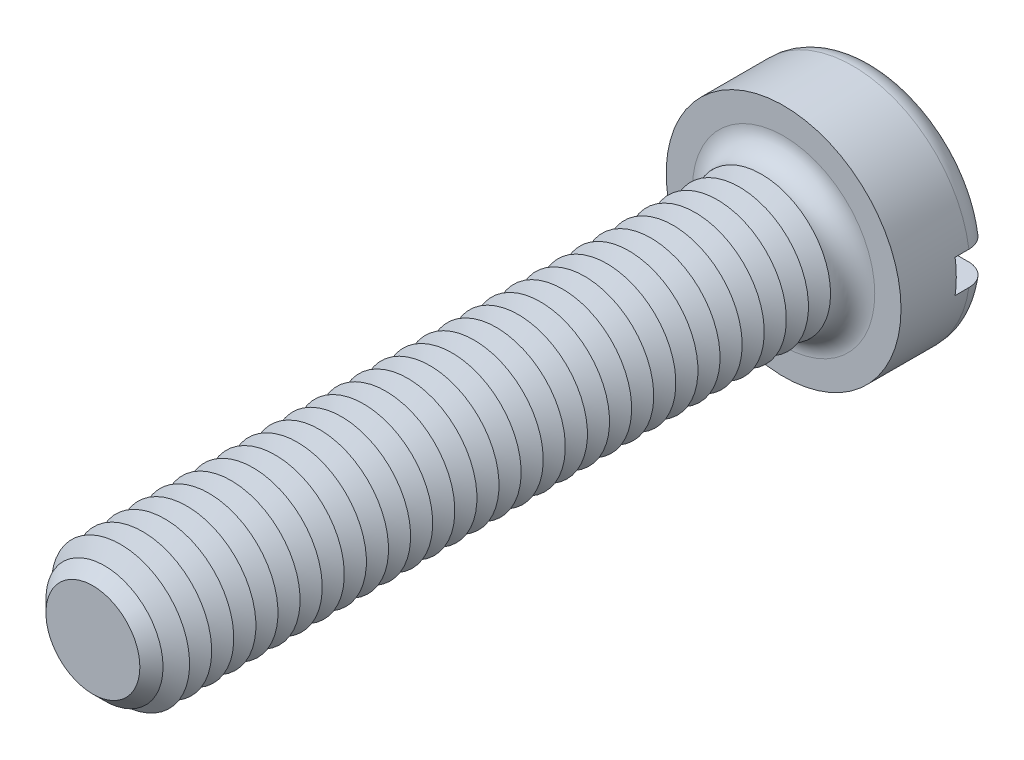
ISO-10303-21;
HEADER;
FILE_DESCRIPTION(('STEP AP214'),'2;1');
FILE_NAME('part.step','',(''),(''),'','','');
FILE_SCHEMA(('AUTOMOTIVE_DESIGN { 1 0 10303 214 1 1 1 1 }'));
ENDSEC;
DATA;
#1=APPLICATION_CONTEXT('core data for automotive mechanical design processes');
#2=APPLICATION_PROTOCOL_DEFINITION('international standard','automotive_design',2000,#1);
#3=PRODUCT_CONTEXT('',#1,'mechanical');
#4=PRODUCT('Part','Part','',(#3));
#5=PRODUCT_RELATED_PRODUCT_CATEGORY('part','',(#4));
#6=PRODUCT_DEFINITION_FORMATION('','',#4);
#7=PRODUCT_DEFINITION_CONTEXT('part definition',#1,'design');
#8=PRODUCT_DEFINITION('design','',#6,#7);
#9=PRODUCT_DEFINITION_SHAPE('','',#8);
#10=(LENGTH_UNIT() NAMED_UNIT(*) SI_UNIT(.MILLI.,.METRE.));
#11=(NAMED_UNIT(*) PLANE_ANGLE_UNIT() SI_UNIT($,.RADIAN.));
#12=(NAMED_UNIT(*) SI_UNIT($,.STERADIAN.) SOLID_ANGLE_UNIT());
#13=UNCERTAINTY_MEASURE_WITH_UNIT(LENGTH_MEASURE(1.E-05),#10,'distance_accuracy_value','');
#14=(GEOMETRIC_REPRESENTATION_CONTEXT(3) GLOBAL_UNCERTAINTY_ASSIGNED_CONTEXT((#13)) GLOBAL_UNIT_ASSIGNED_CONTEXT((#10,
#11,#12)) REPRESENTATION_CONTEXT('',''));
#15=CARTESIAN_POINT('',(0.,0.,0.));
#16=DIRECTION('',(0.,0.,1.));
#17=DIRECTION('',(1.,0.,0.));
#18=AXIS2_PLACEMENT_3D('',#15,#16,#17);
#19=CARTESIAN_POINT('',(0.,0.,-3.3));
#20=DIRECTION('',(0.,0.,1.));
#21=DIRECTION('',(1.,0.,0.));
#22=AXIS2_PLACEMENT_3D('',#19,#20,#21);
#23=PLANE('',#22);
#24=CARTESIAN_POINT('',(0.,0.,-3.3));
#25=DIRECTION('',(0.,0.,1.));
#26=DIRECTION('',(1.,0.,0.));
#27=AXIS2_PLACEMENT_3D('',#24,#25,#26);
#28=CIRCLE('',#27,3.45);
#29=CARTESIAN_POINT('',(-3.39742549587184,0.6,-3.3));
#30=VERTEX_POINT('',#29);
#31=CARTESIAN_POINT('',(3.39742549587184,0.6,-3.3));
#32=VERTEX_POINT('',#31);
#33=EDGE_CURVE('E116',#30,#32,#28,.F.);
#34=ORIENTED_EDGE('',*,*,#33,.T.);
#35=DIRECTION('',(1.,0.,0.));
#36=VECTOR('',#35,1.);
#37=CARTESIAN_POINT('',(-4.25,0.600000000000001,-3.3));
#38=LINE('',#37,#36);
#39=EDGE_CURVE('E111',#30,#32,#38,.T.);
#40=ORIENTED_EDGE('',*,*,#39,.F.);
#41=EDGE_LOOP('',(#34,#40));
#42=FACE_BOUND('',#41,.T.);
#43=ADVANCED_FACE('F39',(#42),#23,.F.);
#44=CARTESIAN_POINT('',(0.,0.,-2.5));
#45=DIRECTION('',(0.,0.,1.));
#46=DIRECTION('',(1.,0.,0.));
#47=AXIS2_PLACEMENT_3D('',#44,#45,#46);
#48=TOROIDAL_SURFACE('',#47,3.45,0.8);
#49=CARTESIAN_POINT('',(-4.06369072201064,0.600000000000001,-2.95537828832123));
#50=CARTESIAN_POINT('',(-4.03774340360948,0.600000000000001,-2.99245078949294));
#51=CARTESIAN_POINT('',(-4.00861849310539,0.600000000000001,-3.02734231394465));
#52=CARTESIAN_POINT('',(-3.94488199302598,0.600000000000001,-3.0917502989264));
#53=CARTESIAN_POINT('',(-3.91026320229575,0.600000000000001,-3.12125959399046));
#54=CARTESIAN_POINT('',(-3.83660561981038,0.600000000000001,-3.17403695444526));
#55=CARTESIAN_POINT('',(-3.79757117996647,0.6,-3.19731109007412));
#56=CARTESIAN_POINT('',(-3.71618817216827,0.6,-3.23703443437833));
#57=CARTESIAN_POINT('',(-3.67384041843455,0.6,-3.25348531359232));
#58=CARTESIAN_POINT('',(-3.58661930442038,0.6,-3.2792758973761));
#59=CARTESIAN_POINT('',(-3.54172669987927,0.6,-3.288550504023));
#60=CARTESIAN_POINT('',(-3.45102322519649,0.6,-3.29952632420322));
#61=CARTESIAN_POINT('',(-3.40521225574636,0.6,-3.30122671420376));
#62=CARTESIAN_POINT('',(-3.31340831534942,0.6,-3.29701196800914));
#63=CARTESIAN_POINT('',(-3.26741940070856,0.6,-3.29100823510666));
#64=CARTESIAN_POINT('',(-3.17708556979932,0.6,-3.27141469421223));
#65=CARTESIAN_POINT('',(-3.13274074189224,0.6,-3.25782447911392));
#66=CARTESIAN_POINT('',(-3.0466814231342,0.6,-3.22332549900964));
#67=CARTESIAN_POINT('',(-3.00498444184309,0.6,-3.20237301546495));
#68=CARTESIAN_POINT('',(-2.92572251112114,0.6,-3.15372961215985));
#69=CARTESIAN_POINT('',(-2.88815755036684,0.6,-3.12603871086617));
#70=CARTESIAN_POINT('',(-2.81847654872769,0.6,-3.06483322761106));
#71=CARTESIAN_POINT('',(-2.78633186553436,0.6,-3.03135128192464));
#72=CARTESIAN_POINT('',(-2.72824805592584,0.6,-2.95937651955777));
#73=CARTESIAN_POINT('',(-2.70230829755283,0.6,-2.92088421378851));
#74=CARTESIAN_POINT('',(-2.65791262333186,0.6,-2.84074227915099));
#75=CARTESIAN_POINT('',(-2.63932560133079,0.6,-2.79916531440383));
#76=CARTESIAN_POINT('',(-2.60958432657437,0.6,-2.7134333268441));
#77=CARTESIAN_POINT('',(-2.59842889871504,0.6,-2.66927871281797));
#78=CARTESIAN_POINT('',(-2.58411140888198,0.6,-2.58073966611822));
#79=CARTESIAN_POINT('',(-2.58077086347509,0.6,-2.5363840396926));
#80=CARTESIAN_POINT('',(-2.58167367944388,0.6,-2.44775208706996));
#81=CARTESIAN_POINT('',(-2.58591644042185,0.6,-2.40347575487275));
#82=CARTESIAN_POINT('',(-2.60175154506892,0.6,-2.31675105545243));
#83=CARTESIAN_POINT('',(-2.61326489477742,0.6,-2.27428821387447));
#84=CARTESIAN_POINT('',(-2.6431863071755,0.6,-2.19186794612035));
#85=CARTESIAN_POINT('',(-2.66159465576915,0.6,-2.15191062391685));
#86=CARTESIAN_POINT('',(-2.70494650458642,0.6,-2.07517696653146));
#87=CARTESIAN_POINT('',(-2.72995486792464,0.6,-2.03843731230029));
#88=CARTESIAN_POINT('',(-2.7856570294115,0.6,-1.96955746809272));
#89=CARTESIAN_POINT('',(-2.81635145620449,0.6,-1.93741778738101));
#90=CARTESIAN_POINT('',(-2.88329572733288,0.6,-1.87788048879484));
#91=CARTESIAN_POINT('',(-2.91965530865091,0.6,-1.85060625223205));
#92=CARTESIAN_POINT('',(-2.9963658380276,0.6,-1.80241044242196));
#93=CARTESIAN_POINT('',(-3.03671721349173,0.6,-1.78148955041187));
#94=CARTESIAN_POINT('',(-3.12111125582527,0.6,-1.74619829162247));
#95=CARTESIAN_POINT('',(-3.16521020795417,0.6,-1.73196239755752));
#96=CARTESIAN_POINT('',(-3.25516487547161,0.6,-1.71103773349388));
#97=CARTESIAN_POINT('',(-3.30102068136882,0.6,-1.70434935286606));
#98=CARTESIAN_POINT('',(-3.39352689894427,0.6,-1.69870104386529));
#99=CARTESIAN_POINT('',(-3.44018061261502,0.6,-1.69979487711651));
#100=CARTESIAN_POINT('',(-3.53263583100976,0.6,-1.70983959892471));
#101=CARTESIAN_POINT('',(-3.57843734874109,0.6,-1.71879036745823));
#102=CARTESIAN_POINT('',(-3.66763544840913,0.6,-1.74426972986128));
#103=CARTESIAN_POINT('',(-3.71104292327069,0.6,-1.76076015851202));
#104=CARTESIAN_POINT('',(-3.79442616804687,0.6,-1.80087686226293));
#105=CARTESIAN_POINT('',(-3.83440212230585,0.600000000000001,-1.82450275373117));
#106=CARTESIAN_POINT('',(-3.90929765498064,0.600000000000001,-1.87793548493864));
#107=CARTESIAN_POINT('',(-3.94426963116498,0.600000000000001,-1.90766887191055));
#108=CARTESIAN_POINT('',(-4.00864839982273,0.600000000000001,-1.9726503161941));
#109=CARTESIAN_POINT('',(-4.03805555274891,0.600000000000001,-2.00789801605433));
#110=CARTESIAN_POINT('',(-4.09009460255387,0.600000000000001,-2.08244463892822));
#111=CARTESIAN_POINT('',(-4.11280448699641,0.600000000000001,-2.12168912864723));
#112=CARTESIAN_POINT('',(-4.15124086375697,0.600000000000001,-2.2034588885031));
#113=CARTESIAN_POINT('',(-4.16696802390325,0.600000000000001,-2.24598384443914));
#114=CARTESIAN_POINT('',(-4.19085131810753,0.600000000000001,-2.33267862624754));
#115=CARTESIAN_POINT('',(-4.19907708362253,0.600000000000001,-2.37682928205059));
#116=CARTESIAN_POINT('',(-4.2079638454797,0.600000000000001,-2.46589754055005));
#117=CARTESIAN_POINT('',(-4.20862315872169,0.600000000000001,-2.51081531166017));
#118=CARTESIAN_POINT('',(-4.20236829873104,0.600000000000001,-2.59993343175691));
#119=CARTESIAN_POINT('',(-4.19548454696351,0.600000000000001,-2.64413593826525));
#120=CARTESIAN_POINT('',(-4.17439924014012,0.600000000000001,-2.73071930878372));
#121=CARTESIAN_POINT('',(-4.16020675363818,0.600000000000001,-2.77310235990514));
#122=CARTESIAN_POINT('',(-4.1318825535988,0.600000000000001,-2.83880495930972));
#123=CARTESIAN_POINT('',(-4.11991183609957,0.600000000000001,-2.86307959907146));
#124=CARTESIAN_POINT('',(-4.09356927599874,0.600000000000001,-2.91028856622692));
#125=CARTESIAN_POINT('',(-4.07919744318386,0.600000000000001,-2.9332228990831));
#126=CARTESIAN_POINT('',(-4.06369072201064,0.600000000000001,-2.95537828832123));
#127=B_SPLINE_CURVE_WITH_KNOTS('',3,(#49,#50,#51,#52,#53,#54,#55,#56,#57,#58,#59,#60,#61,#62,
#63,#64,#65,#66,#67,#68,#69,#70,#71,#72,#73,#74,#75,#76,#77,#78,#79,#80,#81,#82,#83,#84,#85,#86,
#87,#88,#89,#90,#91,#92,#93,#94,#95,#96,#97,#98,#99,#100,#101,#102,#103,#104,#105,#106,#107,
#108,#109,#110,#111,#112,#113,#114,#115,#116,#117,#118,#119,#120,#121,#122,#123,#124,#125,#126),
.UNSPECIFIED.,.T.,.F.,(4,2,2,2,2,2,2,2,2,2,2,2,2,2,2,2,2,2,2,2,2,2,2,2,2,2,2,2,2,2,2,2,2,2,2,2,
2,2,4),(0.,0.13565225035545,0.271483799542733,0.407182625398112,0.542848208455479,
0.679730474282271,0.816627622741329,0.955113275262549,1.09360635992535,1.23293614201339,
1.37226554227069,1.51083389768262,1.64938813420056,1.78534653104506,1.92128342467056,
2.0540840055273,2.18687407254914,2.31824564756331,2.44962267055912,2.58234229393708,
2.71507659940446,2.85080630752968,2.98655056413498,3.12491938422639,3.26329534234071,
3.40262816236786,3.54195885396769,3.68059194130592,3.81921757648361,3.95626453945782,
4.09330262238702,4.2286754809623,4.36403538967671,4.49812564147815,4.63224572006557,
4.76582687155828,4.89924267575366,4.98031194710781,5.0613808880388),.UNSPECIFIED.);
#128=CARTESIAN_POINT('',(-4.20743389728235,0.600000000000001,-2.50000000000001));
#129=VERTEX_POINT('',#128);
#130=EDGE_CURVE('E425',#129,#30,#127,.T.);
#131=ORIENTED_EDGE('',*,*,#130,.F.);
#132=CARTESIAN_POINT('',(0.,0.,-2.5));
#133=DIRECTION('',(0.,0.,1.));
#134=DIRECTION('',(1.,0.,0.));
#135=AXIS2_PLACEMENT_3D('',#132,#133,#134);
#136=CIRCLE('',#135,4.25);
#137=CARTESIAN_POINT('',(4.20743389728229,0.599999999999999,-2.5));
#138=VERTEX_POINT('',#137);
#139=EDGE_CURVE('E125',#138,#129,#136,.T.);
#140=ORIENTED_EDGE('',*,*,#139,.F.);
#141=CARTESIAN_POINT('',(2.63947327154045,0.6,-2.79608831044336));
#142=CARTESIAN_POINT('',(2.65655980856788,0.6,-2.83790320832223));
#143=CARTESIAN_POINT('',(2.67725642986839,0.6,-2.87828303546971));
#144=CARTESIAN_POINT('',(2.72519250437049,0.6,-2.95500233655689));
#145=CARTESIAN_POINT('',(2.75244152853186,0.6,-2.9913357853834));
#146=CARTESIAN_POINT('',(2.81257938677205,0.6,-3.05889430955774));
#147=CARTESIAN_POINT('',(2.84545995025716,0.6,-3.09012674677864));
#148=CARTESIAN_POINT('',(2.91591143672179,0.6,-3.14672620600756));
#149=CARTESIAN_POINT('',(2.95348119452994,0.6,-3.17209468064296));
#150=CARTESIAN_POINT('',(3.03291143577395,0.6,-3.21669611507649));
#151=CARTESIAN_POINT('',(3.07483186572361,0.6,-3.23582234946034));
#152=CARTESIAN_POINT('',(3.16126659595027,0.6,-3.26686062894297));
#153=CARTESIAN_POINT('',(3.2057811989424,0.6,-3.27877183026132));
#154=CARTESIAN_POINT('',(3.29669878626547,0.6,-3.29514603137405));
#155=CARTESIAN_POINT('',(3.34311773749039,0.6,-3.29952056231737));
#156=CARTESIAN_POINT('',(3.43603189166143,0.6,-3.30040472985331));
#157=CARTESIAN_POINT('',(3.48252709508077,0.6,-3.29691431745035));
#158=CARTESIAN_POINT('',(3.57420049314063,0.6,-3.28214240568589));
#159=CARTESIAN_POINT('',(3.61938038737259,0.6,-3.27087147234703));
#160=CARTESIAN_POINT('',(3.70717477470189,0.6,-3.24082890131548));
#161=CARTESIAN_POINT('',(3.74978938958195,0.6,-3.22205762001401));
#162=CARTESIAN_POINT('',(3.83078828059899,0.6,-3.17773607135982));
#163=CARTESIAN_POINT('',(3.86921015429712,0.599999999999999,-3.15225453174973));
#164=CARTESIAN_POINT('',(3.94116038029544,0.599999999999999,-3.09512672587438));
#165=CARTESIAN_POINT('',(3.9746890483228,0.599999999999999,-3.06348085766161));
#166=CARTESIAN_POINT('',(4.03545911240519,0.599999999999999,-2.99534640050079));
#167=CARTESIAN_POINT('',(4.06277344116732,0.599999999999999,-2.95892285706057));
#168=CARTESIAN_POINT('',(4.11082191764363,0.599999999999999,-2.88196698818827));
#169=CARTESIAN_POINT('',(4.13155647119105,0.599999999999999,-2.84143491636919));
#170=CARTESIAN_POINT('',(4.16563480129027,0.599999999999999,-2.75787550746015));
#171=CARTESIAN_POINT('',(4.1790544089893,0.599999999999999,-2.71487908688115));
#172=CARTESIAN_POINT('',(4.19843340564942,0.599999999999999,-2.62723691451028));
#173=CARTESIAN_POINT('',(4.20439310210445,0.599999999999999,-2.58259123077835));
#174=CARTESIAN_POINT('',(4.2086595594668,0.599999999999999,-2.49321831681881));
#175=CARTESIAN_POINT('',(4.20701422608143,0.599999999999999,-2.4484933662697));
#176=CARTESIAN_POINT('',(4.1962295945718,0.599999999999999,-2.35995704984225));
#177=CARTESIAN_POINT('',(4.18709040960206,0.599999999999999,-2.31614567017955));
#178=CARTESIAN_POINT('',(4.16160290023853,0.599999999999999,-2.23072100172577));
#179=CARTESIAN_POINT('',(4.14526169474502,0.599999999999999,-2.18910558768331));
#180=CARTESIAN_POINT('',(4.10585410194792,0.599999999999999,-2.10919238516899));
#181=CARTESIAN_POINT('',(4.08278762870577,0.599999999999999,-2.07089463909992));
#182=CARTESIAN_POINT('',(4.030487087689,0.599999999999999,-1.99851484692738));
#183=CARTESIAN_POINT('',(4.00122628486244,0.599999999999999,-1.9644521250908));
#184=CARTESIAN_POINT('',(3.93744772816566,0.599999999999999,-1.90166877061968));
#185=CARTESIAN_POINT('',(3.90292977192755,0.599999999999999,-1.87294834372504));
#186=CARTESIAN_POINT('',(3.82928727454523,0.599999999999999,-1.82137853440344));
#187=CARTESIAN_POINT('',(3.79012374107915,0.6,-1.79858484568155));
#188=CARTESIAN_POINT('',(3.70856025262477,0.6,-1.75980712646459));
#189=CARTESIAN_POINT('',(3.66616010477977,0.6,-1.74382350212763));
#190=CARTESIAN_POINT('',(3.57878495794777,0.6,-1.71891499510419));
#191=CARTESIAN_POINT('',(3.53378519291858,0.6,-1.71007699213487));
#192=CARTESIAN_POINT('',(3.44294322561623,0.6,-1.69998722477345));
#193=CARTESIAN_POINT('',(3.3971009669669,0.6,-1.69873596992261));
#194=CARTESIAN_POINT('',(3.30531297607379,0.6,-1.70385439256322));
#195=CARTESIAN_POINT('',(3.25937213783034,0.6,-1.71031204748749));
#196=CARTESIAN_POINT('',(3.1692099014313,0.6,-1.73080107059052));
#197=CARTESIAN_POINT('',(3.12498860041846,0.6,-1.74483286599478));
#198=CARTESIAN_POINT('',(3.03926209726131,0.6,-1.78018941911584));
#199=CARTESIAN_POINT('',(2.99777407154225,0.6,-1.80155586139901));
#200=CARTESIAN_POINT('',(2.91899881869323,0.6,-1.85098881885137));
#201=CARTESIAN_POINT('',(2.88171158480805,0.6,-1.8790553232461));
#202=CARTESIAN_POINT('',(2.81266124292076,0.6,-1.94094884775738));
#203=CARTESIAN_POINT('',(2.78086710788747,0.6,-1.97474122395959));
#204=CARTESIAN_POINT('',(2.72353615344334,0.6,-2.0472724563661));
#205=CARTESIAN_POINT('',(2.69799841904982,0.6,-2.08601058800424));
#206=CARTESIAN_POINT('',(2.65444718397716,0.6,-2.16655019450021));
#207=CARTESIAN_POINT('',(2.63629889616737,0.6,-2.20827875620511));
#208=CARTESIAN_POINT('',(2.60744942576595,0.6,-2.29424821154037));
#209=CARTESIAN_POINT('',(2.59674901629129,0.6,-2.33848936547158));
#210=CARTESIAN_POINT('',(2.5833312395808,0.6,-2.42714258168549));
#211=CARTESIAN_POINT('',(2.58043995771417,0.6,-2.47152848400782));
#212=CARTESIAN_POINT('',(2.58224493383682,0.6,-2.56010574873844));
#213=CARTESIAN_POINT('',(2.58693104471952,0.6,-2.60429729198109));
#214=CARTESIAN_POINT('',(2.60020046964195,0.6,-2.67311978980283));
#215=CARTESIAN_POINT('',(2.60635343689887,0.6,-2.69824441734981));
#216=CARTESIAN_POINT('',(2.62110140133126,0.6,-2.74776540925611));
#217=CARTESIAN_POINT('',(2.62969634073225,0.6,-2.77216179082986));
#218=CARTESIAN_POINT('',(2.63947327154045,0.6,-2.79608831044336));
#219=B_SPLINE_CURVE_WITH_KNOTS('',3,(#141,#142,#143,#144,#145,#146,#147,#148,#149,#150,#151,
#152,#153,#154,#155,#156,#157,#158,#159,#160,#161,#162,#163,#164,#165,#166,#167,#168,#169,#170,
#171,#172,#173,#174,#175,#176,#177,#178,#179,#180,#181,#182,#183,#184,#185,#186,#187,#188,#189,
#190,#191,#192,#193,#194,#195,#196,#197,#198,#199,#200,#201,#202,#203,#204,#205,#206,#207,#208,
#209,#210,#211,#212,#213,#214,#215,#216,#217,#218),.UNSPECIFIED.,.T.,.F.,(4,2,2,2,2,2,2,2,2,2,2,
2,2,2,2,2,2,2,2,2,2,2,2,2,2,2,2,2,2,2,2,2,2,2,2,2,2,2,4),(0.,0.135416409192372,
0.271031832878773,0.406449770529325,0.541834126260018,0.679424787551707,0.817031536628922,
0.956242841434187,1.09545501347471,1.23447850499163,1.37349539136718,1.51114036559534,
1.64877645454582,1.78470267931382,1.92062051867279,2.05510117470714,2.1895762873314,
2.32320547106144,2.45683263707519,2.59032801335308,2.72382509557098,2.85791055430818,
2.99200117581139,3.12730969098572,3.26262627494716,3.39956435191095,3.53651162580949,
3.67503685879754,3.81356990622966,3.95290367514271,4.09223721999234,4.23075602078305,
4.36925455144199,4.50509949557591,4.6409585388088,4.77376594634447,4.90639565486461,
4.98388287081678,5.06136825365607),.UNSPECIFIED.);
#220=EDGE_CURVE('E427',#32,#138,#219,.T.);
#221=ORIENTED_EDGE('',*,*,#220,.F.);
#222=ORIENTED_EDGE('',*,*,#33,.F.);
#223=EDGE_LOOP('',(#131,#140,#221,#222));
#224=FACE_BOUND('',#223,.T.);
#225=ADVANCED_FACE('F409',(#224),#48,.T.);
#226=CARTESIAN_POINT('',(0.,0.,-3.3));
#227=DIRECTION('',(0.,0.,1.));
#228=DIRECTION('',(1.,0.,0.));
#229=AXIS2_PLACEMENT_3D('',#226,#227,#228);
#230=CYLINDRICAL_SURFACE('',#229,4.25);
#231=DIRECTION('',(0.,0.,1.));
#232=VECTOR('',#231,1.);
#233=CARTESIAN_POINT('',(4.20743389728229,0.599999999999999,-3.3));
#234=LINE('',#233,#232);
#235=CARTESIAN_POINT('',(4.20743389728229,0.599999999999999,-2.));
#236=VERTEX_POINT('',#235);
#237=EDGE_CURVE('E442',#138,#236,#234,.T.);
#238=ORIENTED_EDGE('',*,*,#237,.F.);
#239=ORIENTED_EDGE('',*,*,#139,.T.);
#240=DIRECTION('',(0.,0.,1.));
#241=VECTOR('',#240,1.);
#242=CARTESIAN_POINT('',(-4.20743389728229,0.600000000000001,-3.3));
#243=LINE('',#242,#241);
#244=CARTESIAN_POINT('',(-4.20743389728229,0.600000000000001,-2.));
#245=VERTEX_POINT('',#244);
#246=EDGE_CURVE('E63',#245,#129,#243,.F.);
#247=ORIENTED_EDGE('',*,*,#246,.F.);
#248=CARTESIAN_POINT('',(0.,0.,-2.));
#249=DIRECTION('',(0.,0.,-1.));
#250=DIRECTION('',(-1.,0.,0.));
#251=AXIS2_PLACEMENT_3D('',#248,#249,#250);
#252=CIRCLE('',#251,4.25);
#253=CARTESIAN_POINT('',(-4.20743389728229,-0.599999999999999,-2.));
#254=VERTEX_POINT('',#253);
#255=EDGE_CURVE('E43',#245,#254,#252,.F.);
#256=ORIENTED_EDGE('',*,*,#255,.T.);
#257=DIRECTION('',(0.,0.,1.));
#258=VECTOR('',#257,1.);
#259=CARTESIAN_POINT('',(-4.20743389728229,-0.599999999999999,-3.3));
#260=LINE('',#259,#258);
#261=CARTESIAN_POINT('',(-4.20743389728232,-0.599999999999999,-2.5));
#262=VERTEX_POINT('',#261);
#263=EDGE_CURVE('E439',#262,#254,#260,.T.);
#264=ORIENTED_EDGE('',*,*,#263,.F.);
#265=CARTESIAN_POINT('',(4.20743389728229,-0.600000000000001,-2.5));
#266=VERTEX_POINT('',#265);
#267=EDGE_CURVE('E127',#262,#266,#136,.T.);
#268=ORIENTED_EDGE('',*,*,#267,.T.);
#269=DIRECTION('',(0.,0.,1.));
#270=VECTOR('',#269,1.);
#271=CARTESIAN_POINT('',(4.20743389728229,-0.600000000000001,-3.3));
#272=LINE('',#271,#270);
#273=CARTESIAN_POINT('',(4.20743389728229,-0.600000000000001,-2.));
#274=VERTEX_POINT('',#273);
#275=EDGE_CURVE('E55',#274,#266,#272,.F.);
#276=ORIENTED_EDGE('',*,*,#275,.F.);
#277=EDGE_CURVE('E11',#274,#236,#252,.F.);
#278=ORIENTED_EDGE('',*,*,#277,.T.);
#279=EDGE_LOOP('',(#238,#239,#247,#256,#264,#268,#276,#278));
#280=FACE_BOUND('',#279,.T.);
#281=CARTESIAN_POINT('',(0.,0.,0.));
#282=DIRECTION('',(0.,0.,1.));
#283=DIRECTION('',(1.,0.,0.));
#284=AXIS2_PLACEMENT_3D('',#281,#282,#283);
#285=CIRCLE('',#284,4.25);
#286=CARTESIAN_POINT('',(4.25,0.,0.));
#287=VERTEX_POINT('',#286);
#288=EDGE_CURVE('E444',#287,#287,#285,.T.);
#289=ORIENTED_EDGE('',*,*,#288,.F.);
#290=EDGE_LOOP('',(#289));
#291=FACE_BOUND('',#290,.T.);
#292=ADVANCED_FACE('F405',(#280,#291),#230,.T.);
#293=CARTESIAN_POINT('',(3.39742549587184,-0.6,-3.3));
#294=VERTEX_POINT('',#293);
#295=CARTESIAN_POINT('',(-3.39742549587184,-0.6,-3.3));
#296=VERTEX_POINT('',#295);
#297=EDGE_CURVE('E109',#294,#296,#28,.F.);
#298=ORIENTED_EDGE('',*,*,#297,.T.);
#299=DIRECTION('',(-1.,0.,0.));
#300=VECTOR('',#299,1.);
#301=CARTESIAN_POINT('',(-4.25,-0.599999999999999,-3.3));
#302=LINE('',#301,#300);
#303=EDGE_CURVE('E96',#294,#296,#302,.T.);
#304=ORIENTED_EDGE('',*,*,#303,.F.);
#305=EDGE_LOOP('',(#298,#304));
#306=FACE_BOUND('',#305,.T.);
#307=ADVANCED_FACE('F108',(#306),#23,.F.);
#308=CARTESIAN_POINT('',(0.,0.,0.));
#309=DIRECTION('',(0.,0.,1.));
#310=DIRECTION('',(1.,0.,0.));
#311=AXIS2_PLACEMENT_3D('',#308,#309,#310);
#312=PLANE('',#311);
#313=CARTESIAN_POINT('',(0.,0.,0.));
#314=DIRECTION('',(0.,0.,1.));
#315=DIRECTION('',(1.,0.,0.));
#316=AXIS2_PLACEMENT_3D('',#313,#314,#315);
#317=CIRCLE('',#316,3.3);
#318=CARTESIAN_POINT('',(3.3,0.,0.));
#319=VERTEX_POINT('',#318);
#320=EDGE_CURVE('E115',#319,#319,#317,.F.);
#321=ORIENTED_EDGE('',*,*,#320,.T.);
#322=EDGE_LOOP('',(#321));
#323=FACE_BOUND('',#322,.T.);
#324=ORIENTED_EDGE('',*,*,#288,.T.);
#325=EDGE_LOOP('',(#324));
#326=FACE_BOUND('',#325,.T.);
#327=ADVANCED_FACE('F404',(#323,#326),#312,.T.);
#328=CARTESIAN_POINT('',(-4.06369072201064,-0.599999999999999,-2.95537828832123));
#329=CARTESIAN_POINT('',(-4.08928577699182,-0.599999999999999,-2.91880204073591));
#330=CARTESIAN_POINT('',(-4.11182555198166,-0.599999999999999,-2.88005030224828));
#331=CARTESIAN_POINT('',(-4.15010404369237,-0.599999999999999,-2.79928452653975));
#332=CARTESIAN_POINT('',(-4.16583526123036,-0.599999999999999,-2.75726695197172));
#333=CARTESIAN_POINT('',(-4.19000286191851,-0.599999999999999,-2.67118996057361));
#334=CARTESIAN_POINT('',(-4.19844101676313,-0.599999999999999,-2.62713104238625));
#335=CARTESIAN_POINT('',(-4.20777174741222,-0.599999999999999,-2.53823222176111));
#336=CARTESIAN_POINT('',(-4.20866608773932,-0.599999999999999,-2.49339250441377));
#337=CARTESIAN_POINT('',(-4.20289683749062,-0.599999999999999,-2.40433856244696));
#338=CARTESIAN_POINT('',(-4.19625607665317,-0.599999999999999,-2.36012285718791));
#339=CARTESIAN_POINT('',(-4.17565084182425,-0.599999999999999,-2.27343166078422));
#340=CARTESIAN_POINT('',(-4.16168615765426,-0.599999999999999,-2.23095621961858));
#341=CARTESIAN_POINT('',(-4.12683188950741,-0.599999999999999,-2.14890863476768));
#342=CARTESIAN_POINT('',(-4.10593663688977,-0.599999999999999,-2.10933890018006));
#343=CARTESIAN_POINT('',(-4.05783763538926,-0.599999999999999,-2.03424145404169));
#344=CARTESIAN_POINT('',(-4.03063375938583,-0.599999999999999,-1.99871382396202));
#345=CARTESIAN_POINT('',(-3.97052236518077,-0.599999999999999,-1.93246905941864));
#346=CARTESIAN_POINT('',(-3.93758114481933,-0.599999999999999,-1.90178251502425));
#347=CARTESIAN_POINT('',(-3.86706007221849,-0.599999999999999,-1.84630837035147));
#348=CARTESIAN_POINT('',(-3.82948001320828,-0.6,-1.82152103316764));
#349=CARTESIAN_POINT('',(-3.75033766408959,-0.6,-1.77826995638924));
#350=CARTESIAN_POINT('',(-3.70873831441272,-0.6,-1.7598740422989));
#351=CARTESIAN_POINT('',(-3.62306661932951,-0.6,-1.73023196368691));
#352=CARTESIAN_POINT('',(-3.57899411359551,-0.6,-1.71898626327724));
#353=CARTESIAN_POINT('',(-3.48904845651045,-0.6,-1.70382025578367));
#354=CARTESIAN_POINT('',(-3.44315982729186,-0.6,-1.69999172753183));
#355=CARTESIAN_POINT('',(-3.35138360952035,-0.6,-1.7000083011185));
#356=CARTESIAN_POINT('',(-3.30549602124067,-0.6,-1.70385391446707));
#357=CARTESIAN_POINT('',(-3.21452492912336,-0.6,-1.71917227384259));
#358=CARTESIAN_POINT('',(-3.16945455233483,-0.6,-1.73072307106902));
#359=CARTESIAN_POINT('',(-3.08188104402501,-0.6,-1.76120640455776));
#360=CARTESIAN_POINT('',(-3.0393780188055,-0.6,-1.78013924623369));
#361=CARTESIAN_POINT('',(-2.95805296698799,-0.6,-1.82493384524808));
#362=CARTESIAN_POINT('',(-2.9192403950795,-0.6,-1.85081278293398));
#363=CARTESIAN_POINT('',(-2.84656695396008,-0.6,-1.90878317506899));
#364=CARTESIAN_POINT('',(-2.81270591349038,-0.6,-1.94087441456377));
#365=CARTESIAN_POINT('',(-2.75131050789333,-0.6,-2.01002500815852));
#366=CARTESIAN_POINT('',(-2.72371339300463,-0.6,-2.04702860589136));
#367=CARTESIAN_POINT('',(-2.67528742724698,-0.6,-2.12522869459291));
#368=CARTESIAN_POINT('',(-2.65445765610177,-0.6,-2.1664246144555));
#369=CARTESIAN_POINT('',(-2.62065354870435,-0.6,-2.25087266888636));
#370=CARTESIAN_POINT('',(-2.60751663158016,-0.6,-2.29405971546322));
#371=CARTESIAN_POINT('',(-2.58885106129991,-0.6,-2.38204659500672));
#372=CARTESIAN_POINT('',(-2.58332131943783,-0.6,-2.42684619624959));
#373=CARTESIAN_POINT('',(-2.58009777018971,-0.6,-2.51580379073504));
#374=CARTESIAN_POINT('',(-2.58224575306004,-0.6,-2.55995612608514));
#375=CARTESIAN_POINT('',(-2.59395205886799,-0.6,-2.64726495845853));
#376=CARTESIAN_POINT('',(-2.60351013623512,-0.6,-2.69042148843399));
#377=CARTESIAN_POINT('',(-2.62967159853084,-0.6,-2.77438771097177));
#378=CARTESIAN_POINT('',(-2.64625243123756,-0.6,-2.81520444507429));
#379=CARTESIAN_POINT('',(-2.68592348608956,-0.6,-2.89353901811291));
#380=CARTESIAN_POINT('',(-2.70901418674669,-0.6,-2.9310566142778));
#381=CARTESIAN_POINT('',(-2.7614318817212,-0.6,-3.00240040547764));
#382=CARTESIAN_POINT('',(-2.79085487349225,-0.6,-3.03615603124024));
#383=CARTESIAN_POINT('',(-2.85483456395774,-0.6,-3.09838834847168));
#384=CARTESIAN_POINT('',(-2.88939187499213,-0.6,-3.12686440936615));
#385=CARTESIAN_POINT('',(-2.96351967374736,-0.6,-3.17841283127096));
#386=CARTESIAN_POINT('',(-3.00318741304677,-0.6,-3.20134539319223));
#387=CARTESIAN_POINT('',(-3.08576649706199,-0.6,-3.24034364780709));
#388=CARTESIAN_POINT('',(-3.12867814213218,-0.6,-3.25640870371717));
#389=CARTESIAN_POINT('',(-3.21724048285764,-0.6,-3.28143816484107));
#390=CARTESIAN_POINT('',(-3.26292314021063,-0.6,-3.29028963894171));
#391=CARTESIAN_POINT('',(-3.35512527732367,-0.6,-3.30021681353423));
#392=CARTESIAN_POINT('',(-3.40164474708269,-0.6,-3.30129260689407));
#393=CARTESIAN_POINT('',(-3.49429978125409,-0.6,-3.29560589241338));
#394=CARTESIAN_POINT('',(-3.54043436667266,-0.6,-3.28882735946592));
#395=CARTESIAN_POINT('',(-3.63090382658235,-0.6,-3.26755492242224));
#396=CARTESIAN_POINT('',(-3.67523831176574,-0.6,-3.25305935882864));
#397=CARTESIAN_POINT('',(-3.76046509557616,-0.6,-3.21686867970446));
#398=CARTESIAN_POINT('',(-3.80138087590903,-0.599999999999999,-3.1952288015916));
#399=CARTESIAN_POINT('',(-3.8788986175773,-0.599999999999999,-3.14531817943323));
#400=CARTESIAN_POINT('',(-3.91550599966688,-0.599999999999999,-3.11705590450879));
#401=CARTESIAN_POINT('',(-3.97074313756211,-0.599999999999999,-3.06628809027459));
#402=CARTESIAN_POINT('',(-3.99100743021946,-0.599999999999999,-3.04553102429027));
#403=CARTESIAN_POINT('',(-4.02917385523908,-0.599999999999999,-3.00194762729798));
#404=CARTESIAN_POINT('',(-4.04707600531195,-0.599999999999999,-2.97912131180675));
#405=CARTESIAN_POINT('',(-4.06369072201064,-0.599999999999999,-2.95537828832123));
#406=B_SPLINE_CURVE_WITH_KNOTS('',3,(#328,#329,#330,#331,#332,#333,#334,#335,#336,#337,#338,
#339,#340,#341,#342,#343,#344,#345,#346,#347,#348,#349,#350,#351,#352,#353,#354,#355,#356,#357,
#358,#359,#360,#361,#362,#363,#364,#365,#366,#367,#368,#369,#370,#371,#372,#373,#374,#375,#376,
#377,#378,#379,#380,#381,#382,#383,#384,#385,#386,#387,#388,#389,#390,#391,#392,#393,#394,#395,
#396,#397,#398,#399,#400,#401,#402,#403,#404,#405),.UNSPECIFIED.,.T.,.F.,(4,2,2,2,2,2,2,2,2,2,2,
2,2,2,2,2,2,2,2,2,2,2,2,2,2,2,2,2,2,2,2,2,2,2,2,2,2,2,4),(0.,0.133821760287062,
0.267790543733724,0.401726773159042,0.535631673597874,0.669131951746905,0.802636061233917,
0.936249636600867,1.06986590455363,1.2042952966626,1.3387306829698,1.47455198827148,
1.61038210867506,1.74788249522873,1.88539204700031,2.02431612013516,2.16324594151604,
2.30252260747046,2.4417944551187,2.57960263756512,2.71739207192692,2.85215325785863,
2.98689515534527,3.11887666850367,3.25085380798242,3.38241030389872,3.51397647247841,
3.64769871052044,3.78143690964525,3.91826005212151,4.05509587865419,4.19403485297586,
4.33297216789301,4.47219345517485,4.61144469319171,4.74964356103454,4.887666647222,
4.97453605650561,5.06140481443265),.UNSPECIFIED.);
#407=EDGE_CURVE('E103',#296,#262,#406,.T.);
#408=ORIENTED_EDGE('',*,*,#407,.F.);
#409=ORIENTED_EDGE('',*,*,#297,.F.);
#410=CARTESIAN_POINT('',(2.63947327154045,-0.6,-2.79608831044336));
#411=CARTESIAN_POINT('',(2.62285766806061,-0.6,-2.75541510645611));
#412=CARTESIAN_POINT('',(2.60963282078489,-0.6,-2.71332585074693));
#413=CARTESIAN_POINT('',(2.59042394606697,-0.6,-2.62749460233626));
#414=CARTESIAN_POINT('',(2.58444686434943,-0.6,-2.58375106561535));
#415=CARTESIAN_POINT('',(2.57995287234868,-0.6,-2.49588524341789));
#416=CARTESIAN_POINT('',(2.58143477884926,-0.6,-2.45176301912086));
#417=CARTESIAN_POINT('',(2.59180622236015,-0.6,-2.36440906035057));
#418=CARTESIAN_POINT('',(2.60069434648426,-0.6,-2.32117715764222));
#419=CARTESIAN_POINT('',(2.62554964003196,-0.6,-2.23689909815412));
#420=CARTESIAN_POINT('',(2.6415022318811,-0.6,-2.19584863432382));
#421=CARTESIAN_POINT('',(2.67996913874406,-0.6,-2.11694797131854));
#422=CARTESIAN_POINT('',(2.70248409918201,-0.6,-2.07909808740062));
#423=CARTESIAN_POINT('',(2.75378972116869,-0.6,-2.00702296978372));
#424=CARTESIAN_POINT('',(2.7826732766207,-0.6,-1.97286389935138));
#425=CARTESIAN_POINT('',(2.84564717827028,-0.6,-1.90974167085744));
#426=CARTESIAN_POINT('',(2.87973812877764,-0.6,-1.88077911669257));
#427=CARTESIAN_POINT('',(2.95300941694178,-0.6,-1.82817307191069));
#428=CARTESIAN_POINT('',(2.99228920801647,-0.6,-1.8046680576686));
#429=CARTESIAN_POINT('',(3.07419050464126,-0.6,-1.76446470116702));
#430=CARTESIAN_POINT('',(3.11681231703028,-0.6,-1.74776698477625));
#431=CARTESIAN_POINT('',(3.20492149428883,-0.6,-1.72140945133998));
#432=CARTESIAN_POINT('',(3.25044365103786,-0.6,-1.71186578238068));
#433=CARTESIAN_POINT('',(3.34244451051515,-0.6,-1.70053183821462));
#434=CARTESIAN_POINT('',(3.38892324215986,-0.6,-1.69874179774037));
#435=CARTESIAN_POINT('',(3.48165030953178,-0.6,-1.70299737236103));
#436=CARTESIAN_POINT('',(3.52789766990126,-0.6,-1.70906439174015));
#437=CARTESIAN_POINT('',(3.61869999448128,-0.6,-1.72893768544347));
#438=CARTESIAN_POINT('',(3.6632550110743,-0.6,-1.742743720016));
#439=CARTESIAN_POINT('',(3.7490339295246,-0.6,-1.77760539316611));
#440=CARTESIAN_POINT('',(3.79028083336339,-0.600000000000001,-1.79860440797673));
#441=CARTESIAN_POINT('',(3.86860401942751,-0.600000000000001,-1.84731105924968));
#442=CARTESIAN_POINT('',(3.90568056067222,-0.600000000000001,-1.87501827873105));
#443=CARTESIAN_POINT('',(3.97412845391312,-0.600000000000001,-1.93599408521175));
#444=CARTESIAN_POINT('',(4.00556369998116,-0.600000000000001,-1.96919094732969));
#445=CARTESIAN_POINT('',(4.06233546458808,-0.600000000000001,-2.0404445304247));
#446=CARTESIAN_POINT('',(4.08767237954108,-0.600000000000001,-2.07850093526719));
#447=CARTESIAN_POINT('',(4.13122502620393,-0.600000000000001,-2.15791791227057));
#448=CARTESIAN_POINT('',(4.14951966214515,-0.600000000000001,-2.19923522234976));
#449=CARTESIAN_POINT('',(4.17884974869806,-0.600000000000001,-2.28437065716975));
#450=CARTESIAN_POINT('',(4.18988555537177,-0.600000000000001,-2.32818865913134));
#451=CARTESIAN_POINT('',(4.20430724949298,-0.600000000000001,-2.41670951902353));
#452=CARTESIAN_POINT('',(4.2077528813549,-0.600000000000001,-2.46140265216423));
#453=CARTESIAN_POINT('',(4.20706844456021,-0.600000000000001,-2.55073028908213));
#454=CARTESIAN_POINT('',(4.20293856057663,-0.600000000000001,-2.595364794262));
#455=CARTESIAN_POINT('',(4.18724926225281,-0.600000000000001,-2.68317733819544));
#456=CARTESIAN_POINT('',(4.17571081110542,-0.600000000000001,-2.72635912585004));
#457=CARTESIAN_POINT('',(4.14556645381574,-0.600000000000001,-2.81017999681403));
#458=CARTESIAN_POINT('',(4.12696052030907,-0.600000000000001,-2.85081907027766));
#459=CARTESIAN_POINT('',(4.08317014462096,-0.600000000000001,-2.92852328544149));
#460=CARTESIAN_POINT('',(4.0579684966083,-0.600000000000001,-2.96557872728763));
#461=CARTESIAN_POINT('',(4.00174565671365,-0.600000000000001,-3.034972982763));
#462=CARTESIAN_POINT('',(3.97072429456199,-0.600000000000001,-3.06731165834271));
#463=CARTESIAN_POINT('',(3.90349659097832,-0.600000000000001,-3.12662735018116));
#464=CARTESIAN_POINT('',(3.86725240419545,-0.600000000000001,-3.15356146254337));
#465=CARTESIAN_POINT('',(3.79079809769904,-0.600000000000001,-3.20104156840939));
#466=CARTESIAN_POINT('',(3.75058775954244,-0.6,-3.22158720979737));
#467=CARTESIAN_POINT('',(3.6668595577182,-0.6,-3.25595832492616));
#468=CARTESIAN_POINT('',(3.62330947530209,-0.6,-3.26970530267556));
#469=CARTESIAN_POINT('',(3.53453348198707,-0.6,-3.28979004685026));
#470=CARTESIAN_POINT('',(3.48930745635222,-0.6,-3.29612730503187));
#471=CARTESIAN_POINT('',(3.39787506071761,-0.6,-3.30128612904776));
#472=CARTESIAN_POINT('',(3.35166346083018,-0.6,-3.30001513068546));
#473=CARTESIAN_POINT('',(3.26009663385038,-0.6,-3.28980210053));
#474=CARTESIAN_POINT('',(3.21474142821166,-0.6,-3.28085987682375));
#475=CARTESIAN_POINT('',(3.12577990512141,-0.6,-3.2554540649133));
#476=CARTESIAN_POINT('',(3.08219120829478,-0.6,-3.23892872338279));
#477=CARTESIAN_POINT('',(2.99839730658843,-0.6,-3.1987810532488));
#478=CARTESIAN_POINT('',(2.95819301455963,-0.6,-3.17515681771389));
#479=CARTESIAN_POINT('',(2.88239372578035,-0.6,-3.12147666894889));
#480=CARTESIAN_POINT('',(2.84679445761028,-0.6,-3.09142678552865));
#481=CARTESIAN_POINT('',(2.78127483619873,-0.6,-3.02571584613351));
#482=CARTESIAN_POINT('',(2.75134725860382,-0.6,-2.99006203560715));
#483=CARTESIAN_POINT('',(2.70767232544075,-0.6,-2.92780516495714));
#484=CARTESIAN_POINT('',(2.69197340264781,-0.6,-2.90254809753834));
#485=CARTESIAN_POINT('',(2.66349078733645,-0.6,-2.8504392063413));
#486=CARTESIAN_POINT('',(2.65070705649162,-0.6,-2.82358740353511));
#487=CARTESIAN_POINT('',(2.63947327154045,-0.6,-2.79608831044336));
#488=B_SPLINE_CURVE_WITH_KNOTS('',3,(#410,#411,#412,#413,#414,#415,#416,#417,#418,#419,#420,
#421,#422,#423,#424,#425,#426,#427,#428,#429,#430,#431,#432,#433,#434,#435,#436,#437,#438,#439,
#440,#441,#442,#443,#444,#445,#446,#447,#448,#449,#450,#451,#452,#453,#454,#455,#456,#457,#458,
#459,#460,#461,#462,#463,#464,#465,#466,#467,#468,#469,#470,#471,#472,#473,#474,#475,#476,#477,
#478,#479,#480,#481,#482,#483,#484,#485,#486,#487),.UNSPECIFIED.,.T.,.F.,(4,2,2,2,2,2,2,2,2,2,2,
2,2,2,2,2,2,2,2,2,2,2,2,2,2,2,2,2,2,2,2,2,2,2,2,2,2,2,4),(0.,0.131701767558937,
0.263529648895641,0.395336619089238,0.527118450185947,0.658629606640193,0.790153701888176,
0.923740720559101,1.05734325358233,1.19403504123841,1.33073939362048,1.46961778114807,
1.60850037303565,1.74776210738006,1.88701952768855,2.02520497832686,2.16338184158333,
2.29987843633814,2.43636615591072,2.57127672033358,2.7061806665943,2.84001889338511,
2.97385385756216,3.1073117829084,3.24077022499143,3.37458034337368,3.50839437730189,
3.64323196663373,3.77807698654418,3.91444452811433,4.05082142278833,4.18886086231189,
4.32690375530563,4.46609131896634,4.60531630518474,4.74441121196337,4.88332773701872,
4.97237227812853,5.06141564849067),.UNSPECIFIED.);
#489=EDGE_CURVE('E92',#266,#294,#488,.T.);
#490=ORIENTED_EDGE('',*,*,#489,.F.);
#491=ORIENTED_EDGE('',*,*,#267,.F.);
#492=EDGE_LOOP('',(#408,#409,#490,#491));
#493=FACE_BOUND('',#492,.T.);
#494=ADVANCED_FACE('F113',(#493),#48,.T.);
#495=CARTESIAN_POINT('',(0.,0.,0.799999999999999));
#496=DIRECTION('',(0.,0.,1.));
#497=DIRECTION('',(1.,0.,0.));
#498=AXIS2_PLACEMENT_3D('',#495,#496,#497);
#499=TOROIDAL_SURFACE('',#498,3.3,0.8);
#500=ORIENTED_EDGE('',*,*,#320,.F.);
#501=EDGE_LOOP('',(#500));
#502=FACE_BOUND('',#501,.T.);
#503=CARTESIAN_POINT('',(0.,0.,0.799999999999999));
#504=DIRECTION('',(0.,0.,-1.));
#505=DIRECTION('',(-1.,0.,0.));
#506=AXIS2_PLACEMENT_3D('',#503,#504,#505);
#507=CIRCLE('',#506,2.5);
#508=CARTESIAN_POINT('',(-2.5,0.,0.799999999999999));
#509=VERTEX_POINT('',#508);
#510=EDGE_CURVE('E449',#509,#509,#507,.T.);
#511=ORIENTED_EDGE('',*,*,#510,.T.);
#512=EDGE_LOOP('',(#511));
#513=FACE_BOUND('',#512,.T.);
#514=ADVANCED_FACE('F397',(#502,#513),#499,.F.);
#515=CARTESIAN_POINT('',(0.,0.,1.2));
#516=DIRECTION('',(0.,0.,-1.));
#517=DIRECTION('',(-1.,0.,0.));
#518=AXIS2_PLACEMENT_3D('',#515,#516,#517);
#519=CONICAL_SURFACE('',#518,1.80717967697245,1.0471975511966);
#520=ORIENTED_EDGE('',*,*,#510,.F.);
#521=EDGE_LOOP('',(#520));
#522=FACE_BOUND('',#521,.T.);
#523=CARTESIAN_POINT('',(0.,0.,1.2));
#524=DIRECTION('',(0.,0.,-1.));
#525=DIRECTION('',(-1.,0.,0.));
#526=AXIS2_PLACEMENT_3D('',#523,#524,#525);
#527=CIRCLE('',#526,1.80717967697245);
#528=CARTESIAN_POINT('',(-1.80717967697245,0.,1.2));
#529=VERTEX_POINT('',#528);
#530=EDGE_CURVE('E454',#529,#529,#527,.T.);
#531=ORIENTED_EDGE('',*,*,#530,.T.);
#532=EDGE_LOOP('',(#531));
#533=FACE_BOUND('',#532,.T.);
#534=ADVANCED_FACE('F393',(#522,#533),#519,.T.);
#535=CARTESIAN_POINT('',(0.,0.,1.6));
#536=DIRECTION('',(0.,0.,1.));
#537=DIRECTION('',(1.,0.,0.));
#538=AXIS2_PLACEMENT_3D('',#535,#536,#537);
#539=CONICAL_SURFACE('',#538,2.5,1.0471975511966);
#540=ORIENTED_EDGE('',*,*,#530,.F.);
#541=EDGE_LOOP('',(#540));
#542=FACE_BOUND('',#541,.T.);
#543=CARTESIAN_POINT('',(0.,0.,1.6));
#544=DIRECTION('',(0.,0.,-1.));
#545=DIRECTION('',(-1.,0.,0.));
#546=AXIS2_PLACEMENT_3D('',#543,#544,#545);
#547=CIRCLE('',#546,2.5);
#548=CARTESIAN_POINT('',(-2.5,0.,1.6));
#549=VERTEX_POINT('',#548);
#550=EDGE_CURVE('E460',#549,#549,#547,.T.);
#551=ORIENTED_EDGE('',*,*,#550,.T.);
#552=EDGE_LOOP('',(#551));
#553=FACE_BOUND('',#552,.T.);
#554=ADVANCED_FACE('F389',(#542,#553),#539,.T.);
#555=CARTESIAN_POINT('',(0.,0.,2.));
#556=DIRECTION('',(0.,0.,-1.));
#557=DIRECTION('',(-1.,0.,0.));
#558=AXIS2_PLACEMENT_3D('',#555,#556,#557);
#559=CONICAL_SURFACE('',#558,1.80717967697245,1.0471975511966);
#560=ORIENTED_EDGE('',*,*,#550,.F.);
#561=EDGE_LOOP('',(#560));
#562=FACE_BOUND('',#561,.T.);
#563=CARTESIAN_POINT('',(0.,0.,2.));
#564=DIRECTION('',(0.,0.,-1.));
#565=DIRECTION('',(-1.,0.,0.));
#566=AXIS2_PLACEMENT_3D('',#563,#564,#565);
#567=CIRCLE('',#566,1.80717967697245);
#568=CARTESIAN_POINT('',(-1.80717967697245,0.,2.));
#569=VERTEX_POINT('',#568);
#570=EDGE_CURVE('E464',#569,#569,#567,.T.);
#571=ORIENTED_EDGE('',*,*,#570,.T.);
#572=EDGE_LOOP('',(#571));
#573=FACE_BOUND('',#572,.T.);
#574=ADVANCED_FACE('F385',(#562,#573),#559,.T.);
#575=CARTESIAN_POINT('',(0.,0.,2.4));
#576=DIRECTION('',(0.,0.,1.));
#577=DIRECTION('',(1.,0.,0.));
#578=AXIS2_PLACEMENT_3D('',#575,#576,#577);
#579=CONICAL_SURFACE('',#578,2.5,1.0471975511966);
#580=ORIENTED_EDGE('',*,*,#570,.F.);
#581=EDGE_LOOP('',(#580));
#582=FACE_BOUND('',#581,.T.);
#583=CARTESIAN_POINT('',(0.,0.,2.4));
#584=DIRECTION('',(0.,0.,-1.));
#585=DIRECTION('',(-1.,0.,0.));
#586=AXIS2_PLACEMENT_3D('',#583,#584,#585);
#587=CIRCLE('',#586,2.5);
#588=CARTESIAN_POINT('',(-2.5,0.,2.4));
#589=VERTEX_POINT('',#588);
#590=EDGE_CURVE('E468',#589,#589,#587,.T.);
#591=ORIENTED_EDGE('',*,*,#590,.T.);
#592=EDGE_LOOP('',(#591));
#593=FACE_BOUND('',#592,.T.);
#594=ADVANCED_FACE('F381',(#582,#593),#579,.T.);
#595=CARTESIAN_POINT('',(0.,0.,2.8));
#596=DIRECTION('',(0.,0.,-1.));
#597=DIRECTION('',(-1.,0.,0.));
#598=AXIS2_PLACEMENT_3D('',#595,#596,#597);
#599=CONICAL_SURFACE('',#598,1.80717967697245,1.0471975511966);
#600=ORIENTED_EDGE('',*,*,#590,.F.);
#601=EDGE_LOOP('',(#600));
#602=FACE_BOUND('',#601,.T.);
#603=CARTESIAN_POINT('',(0.,0.,2.8));
#604=DIRECTION('',(0.,0.,-1.));
#605=DIRECTION('',(-1.,0.,0.));
#606=AXIS2_PLACEMENT_3D('',#603,#604,#605);
#607=CIRCLE('',#606,1.80717967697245);
#608=CARTESIAN_POINT('',(-1.80717967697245,0.,2.8));
#609=VERTEX_POINT('',#608);
#610=EDGE_CURVE('E472',#609,#609,#607,.T.);
#611=ORIENTED_EDGE('',*,*,#610,.T.);
#612=EDGE_LOOP('',(#611));
#613=FACE_BOUND('',#612,.T.);
#614=ADVANCED_FACE('F377',(#602,#613),#599,.T.);
#615=CARTESIAN_POINT('',(0.,0.,3.2));
#616=DIRECTION('',(0.,0.,1.));
#617=DIRECTION('',(1.,0.,0.));
#618=AXIS2_PLACEMENT_3D('',#615,#616,#617);
#619=CONICAL_SURFACE('',#618,2.5,1.0471975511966);
#620=ORIENTED_EDGE('',*,*,#610,.F.);
#621=EDGE_LOOP('',(#620));
#622=FACE_BOUND('',#621,.T.);
#623=CARTESIAN_POINT('',(0.,0.,3.2));
#624=DIRECTION('',(0.,0.,-1.));
#625=DIRECTION('',(-1.,0.,0.));
#626=AXIS2_PLACEMENT_3D('',#623,#624,#625);
#627=CIRCLE('',#626,2.5);
#628=CARTESIAN_POINT('',(-2.5,0.,3.2));
#629=VERTEX_POINT('',#628);
#630=EDGE_CURVE('E476',#629,#629,#627,.T.);
#631=ORIENTED_EDGE('',*,*,#630,.T.);
#632=EDGE_LOOP('',(#631));
#633=FACE_BOUND('',#632,.T.);
#634=ADVANCED_FACE('F373',(#622,#633),#619,.T.);
#635=CARTESIAN_POINT('',(0.,0.,3.6));
#636=DIRECTION('',(0.,0.,-1.));
#637=DIRECTION('',(-1.,0.,0.));
#638=AXIS2_PLACEMENT_3D('',#635,#636,#637);
#639=CONICAL_SURFACE('',#638,1.80717967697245,1.0471975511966);
#640=ORIENTED_EDGE('',*,*,#630,.F.);
#641=EDGE_LOOP('',(#640));
#642=FACE_BOUND('',#641,.T.);
#643=CARTESIAN_POINT('',(0.,0.,3.6));
#644=DIRECTION('',(0.,0.,-1.));
#645=DIRECTION('',(-1.,0.,0.));
#646=AXIS2_PLACEMENT_3D('',#643,#644,#645);
#647=CIRCLE('',#646,1.80717967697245);
#648=CARTESIAN_POINT('',(-1.80717967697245,0.,3.6));
#649=VERTEX_POINT('',#648);
#650=EDGE_CURVE('E480',#649,#649,#647,.T.);
#651=ORIENTED_EDGE('',*,*,#650,.T.);
#652=EDGE_LOOP('',(#651));
#653=FACE_BOUND('',#652,.T.);
#654=ADVANCED_FACE('F369',(#642,#653),#639,.T.);
#655=CARTESIAN_POINT('',(0.,0.,4.));
#656=DIRECTION('',(0.,0.,1.));
#657=DIRECTION('',(1.,0.,0.));
#658=AXIS2_PLACEMENT_3D('',#655,#656,#657);
#659=CONICAL_SURFACE('',#658,2.5,1.0471975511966);
#660=ORIENTED_EDGE('',*,*,#650,.F.);
#661=EDGE_LOOP('',(#660));
#662=FACE_BOUND('',#661,.T.);
#663=CARTESIAN_POINT('',(0.,0.,4.));
#664=DIRECTION('',(0.,0.,-1.));
#665=DIRECTION('',(-1.,0.,0.));
#666=AXIS2_PLACEMENT_3D('',#663,#664,#665);
#667=CIRCLE('',#666,2.5);
#668=CARTESIAN_POINT('',(-2.5,0.,4.));
#669=VERTEX_POINT('',#668);
#670=EDGE_CURVE('E484',#669,#669,#667,.T.);
#671=ORIENTED_EDGE('',*,*,#670,.T.);
#672=EDGE_LOOP('',(#671));
#673=FACE_BOUND('',#672,.T.);
#674=ADVANCED_FACE('F365',(#662,#673),#659,.T.);
#675=CARTESIAN_POINT('',(0.,0.,4.4));
#676=DIRECTION('',(0.,0.,-1.));
#677=DIRECTION('',(-1.,0.,0.));
#678=AXIS2_PLACEMENT_3D('',#675,#676,#677);
#679=CONICAL_SURFACE('',#678,1.80717967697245,1.0471975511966);
#680=ORIENTED_EDGE('',*,*,#670,.F.);
#681=EDGE_LOOP('',(#680));
#682=FACE_BOUND('',#681,.T.);
#683=CARTESIAN_POINT('',(0.,0.,4.4));
#684=DIRECTION('',(0.,0.,-1.));
#685=DIRECTION('',(-1.,0.,0.));
#686=AXIS2_PLACEMENT_3D('',#683,#684,#685);
#687=CIRCLE('',#686,1.80717967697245);
#688=CARTESIAN_POINT('',(-1.80717967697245,0.,4.4));
#689=VERTEX_POINT('',#688);
#690=EDGE_CURVE('E488',#689,#689,#687,.T.);
#691=ORIENTED_EDGE('',*,*,#690,.T.);
#692=EDGE_LOOP('',(#691));
#693=FACE_BOUND('',#692,.T.);
#694=ADVANCED_FACE('F361',(#682,#693),#679,.T.);
#695=CARTESIAN_POINT('',(0.,0.,4.8));
#696=DIRECTION('',(0.,0.,1.));
#697=DIRECTION('',(1.,0.,0.));
#698=AXIS2_PLACEMENT_3D('',#695,#696,#697);
#699=CONICAL_SURFACE('',#698,2.5,1.0471975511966);
#700=ORIENTED_EDGE('',*,*,#690,.F.);
#701=EDGE_LOOP('',(#700));
#702=FACE_BOUND('',#701,.T.);
#703=CARTESIAN_POINT('',(0.,0.,4.8));
#704=DIRECTION('',(0.,0.,-1.));
#705=DIRECTION('',(-1.,0.,0.));
#706=AXIS2_PLACEMENT_3D('',#703,#704,#705);
#707=CIRCLE('',#706,2.5);
#708=CARTESIAN_POINT('',(-2.5,0.,4.8));
#709=VERTEX_POINT('',#708);
#710=EDGE_CURVE('E492',#709,#709,#707,.T.);
#711=ORIENTED_EDGE('',*,*,#710,.T.);
#712=EDGE_LOOP('',(#711));
#713=FACE_BOUND('',#712,.T.);
#714=ADVANCED_FACE('F357',(#702,#713),#699,.T.);
#715=CARTESIAN_POINT('',(0.,0.,5.2));
#716=DIRECTION('',(0.,0.,-1.));
#717=DIRECTION('',(-1.,0.,0.));
#718=AXIS2_PLACEMENT_3D('',#715,#716,#717);
#719=CONICAL_SURFACE('',#718,1.80717967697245,1.0471975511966);
#720=ORIENTED_EDGE('',*,*,#710,.F.);
#721=EDGE_LOOP('',(#720));
#722=FACE_BOUND('',#721,.T.);
#723=CARTESIAN_POINT('',(0.,0.,5.2));
#724=DIRECTION('',(0.,0.,-1.));
#725=DIRECTION('',(-1.,0.,0.));
#726=AXIS2_PLACEMENT_3D('',#723,#724,#725);
#727=CIRCLE('',#726,1.80717967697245);
#728=CARTESIAN_POINT('',(-1.80717967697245,0.,5.2));
#729=VERTEX_POINT('',#728);
#730=EDGE_CURVE('E496',#729,#729,#727,.T.);
#731=ORIENTED_EDGE('',*,*,#730,.T.);
#732=EDGE_LOOP('',(#731));
#733=FACE_BOUND('',#732,.T.);
#734=ADVANCED_FACE('F353',(#722,#733),#719,.T.);
#735=CARTESIAN_POINT('',(0.,0.,5.6));
#736=DIRECTION('',(0.,0.,1.));
#737=DIRECTION('',(1.,0.,0.));
#738=AXIS2_PLACEMENT_3D('',#735,#736,#737);
#739=CONICAL_SURFACE('',#738,2.5,1.0471975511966);
#740=ORIENTED_EDGE('',*,*,#730,.F.);
#741=EDGE_LOOP('',(#740));
#742=FACE_BOUND('',#741,.T.);
#743=CARTESIAN_POINT('',(0.,0.,5.6));
#744=DIRECTION('',(0.,0.,-1.));
#745=DIRECTION('',(-1.,0.,0.));
#746=AXIS2_PLACEMENT_3D('',#743,#744,#745);
#747=CIRCLE('',#746,2.5);
#748=CARTESIAN_POINT('',(-2.5,0.,5.6));
#749=VERTEX_POINT('',#748);
#750=EDGE_CURVE('E500',#749,#749,#747,.T.);
#751=ORIENTED_EDGE('',*,*,#750,.T.);
#752=EDGE_LOOP('',(#751));
#753=FACE_BOUND('',#752,.T.);
#754=ADVANCED_FACE('F349',(#742,#753),#739,.T.);
#755=CARTESIAN_POINT('',(0.,0.,6.));
#756=DIRECTION('',(0.,0.,-1.));
#757=DIRECTION('',(-1.,0.,0.));
#758=AXIS2_PLACEMENT_3D('',#755,#756,#757);
#759=CONICAL_SURFACE('',#758,1.80717967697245,1.0471975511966);
#760=ORIENTED_EDGE('',*,*,#750,.F.);
#761=EDGE_LOOP('',(#760));
#762=FACE_BOUND('',#761,.T.);
#763=CARTESIAN_POINT('',(0.,0.,6.));
#764=DIRECTION('',(0.,0.,-1.));
#765=DIRECTION('',(-1.,0.,0.));
#766=AXIS2_PLACEMENT_3D('',#763,#764,#765);
#767=CIRCLE('',#766,1.80717967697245);
#768=CARTESIAN_POINT('',(-1.80717967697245,0.,6.));
#769=VERTEX_POINT('',#768);
#770=EDGE_CURVE('E504',#769,#769,#767,.T.);
#771=ORIENTED_EDGE('',*,*,#770,.T.);
#772=EDGE_LOOP('',(#771));
#773=FACE_BOUND('',#772,.T.);
#774=ADVANCED_FACE('F345',(#762,#773),#759,.T.);
#775=CARTESIAN_POINT('',(0.,0.,6.4));
#776=DIRECTION('',(0.,0.,1.));
#777=DIRECTION('',(1.,0.,0.));
#778=AXIS2_PLACEMENT_3D('',#775,#776,#777);
#779=CONICAL_SURFACE('',#778,2.5,1.0471975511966);
#780=ORIENTED_EDGE('',*,*,#770,.F.);
#781=EDGE_LOOP('',(#780));
#782=FACE_BOUND('',#781,.T.);
#783=CARTESIAN_POINT('',(0.,0.,6.4));
#784=DIRECTION('',(0.,0.,-1.));
#785=DIRECTION('',(-1.,0.,0.));
#786=AXIS2_PLACEMENT_3D('',#783,#784,#785);
#787=CIRCLE('',#786,2.5);
#788=CARTESIAN_POINT('',(-2.5,0.,6.4));
#789=VERTEX_POINT('',#788);
#790=EDGE_CURVE('E508',#789,#789,#787,.T.);
#791=ORIENTED_EDGE('',*,*,#790,.T.);
#792=EDGE_LOOP('',(#791));
#793=FACE_BOUND('',#792,.T.);
#794=ADVANCED_FACE('F341',(#782,#793),#779,.T.);
#795=CARTESIAN_POINT('',(0.,0.,6.8));
#796=DIRECTION('',(0.,0.,-1.));
#797=DIRECTION('',(-1.,0.,0.));
#798=AXIS2_PLACEMENT_3D('',#795,#796,#797);
#799=CONICAL_SURFACE('',#798,1.80717967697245,1.0471975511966);
#800=ORIENTED_EDGE('',*,*,#790,.F.);
#801=EDGE_LOOP('',(#800));
#802=FACE_BOUND('',#801,.T.);
#803=CARTESIAN_POINT('',(0.,0.,6.8));
#804=DIRECTION('',(0.,0.,-1.));
#805=DIRECTION('',(-1.,0.,0.));
#806=AXIS2_PLACEMENT_3D('',#803,#804,#805);
#807=CIRCLE('',#806,1.80717967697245);
#808=CARTESIAN_POINT('',(-1.80717967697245,0.,6.8));
#809=VERTEX_POINT('',#808);
#810=EDGE_CURVE('E512',#809,#809,#807,.T.);
#811=ORIENTED_EDGE('',*,*,#810,.T.);
#812=EDGE_LOOP('',(#811));
#813=FACE_BOUND('',#812,.T.);
#814=ADVANCED_FACE('F337',(#802,#813),#799,.T.);
#815=CARTESIAN_POINT('',(0.,0.,7.2));
#816=DIRECTION('',(0.,0.,1.));
#817=DIRECTION('',(1.,0.,0.));
#818=AXIS2_PLACEMENT_3D('',#815,#816,#817);
#819=CONICAL_SURFACE('',#818,2.5,1.0471975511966);
#820=ORIENTED_EDGE('',*,*,#810,.F.);
#821=EDGE_LOOP('',(#820));
#822=FACE_BOUND('',#821,.T.);
#823=CARTESIAN_POINT('',(0.,0.,7.2));
#824=DIRECTION('',(0.,0.,-1.));
#825=DIRECTION('',(-1.,0.,0.));
#826=AXIS2_PLACEMENT_3D('',#823,#824,#825);
#827=CIRCLE('',#826,2.5);
#828=CARTESIAN_POINT('',(-2.5,0.,7.2));
#829=VERTEX_POINT('',#828);
#830=EDGE_CURVE('E515',#829,#829,#827,.T.);
#831=ORIENTED_EDGE('',*,*,#830,.T.);
#832=EDGE_LOOP('',(#831));
#833=FACE_BOUND('',#832,.T.);
#834=ADVANCED_FACE('F333',(#822,#833),#819,.T.);
#835=CARTESIAN_POINT('',(0.,0.,7.6));
#836=DIRECTION('',(0.,0.,-1.));
#837=DIRECTION('',(-1.,0.,0.));
#838=AXIS2_PLACEMENT_3D('',#835,#836,#837);
#839=CONICAL_SURFACE('',#838,1.80717967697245,1.0471975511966);
#840=ORIENTED_EDGE('',*,*,#830,.F.);
#841=EDGE_LOOP('',(#840));
#842=FACE_BOUND('',#841,.T.);
#843=CARTESIAN_POINT('',(0.,0.,7.6));
#844=DIRECTION('',(0.,0.,-1.));
#845=DIRECTION('',(-1.,0.,0.));
#846=AXIS2_PLACEMENT_3D('',#843,#844,#845);
#847=CIRCLE('',#846,1.80717967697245);
#848=CARTESIAN_POINT('',(-1.80717967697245,0.,7.6));
#849=VERTEX_POINT('',#848);
#850=EDGE_CURVE('E519',#849,#849,#847,.T.);
#851=ORIENTED_EDGE('',*,*,#850,.T.);
#852=EDGE_LOOP('',(#851));
#853=FACE_BOUND('',#852,.T.);
#854=ADVANCED_FACE('F329',(#842,#853),#839,.T.);
#855=CARTESIAN_POINT('',(0.,0.,8.));
#856=DIRECTION('',(0.,0.,1.));
#857=DIRECTION('',(1.,0.,0.));
#858=AXIS2_PLACEMENT_3D('',#855,#856,#857);
#859=CONICAL_SURFACE('',#858,2.5,1.0471975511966);
#860=ORIENTED_EDGE('',*,*,#850,.F.);
#861=EDGE_LOOP('',(#860));
#862=FACE_BOUND('',#861,.T.);
#863=CARTESIAN_POINT('',(0.,0.,8.));
#864=DIRECTION('',(0.,0.,-1.));
#865=DIRECTION('',(-1.,0.,0.));
#866=AXIS2_PLACEMENT_3D('',#863,#864,#865);
#867=CIRCLE('',#866,2.5);
#868=CARTESIAN_POINT('',(-2.5,0.,8.));
#869=VERTEX_POINT('',#868);
#870=EDGE_CURVE('E523',#869,#869,#867,.T.);
#871=ORIENTED_EDGE('',*,*,#870,.T.);
#872=EDGE_LOOP('',(#871));
#873=FACE_BOUND('',#872,.T.);
#874=ADVANCED_FACE('F325',(#862,#873),#859,.T.);
#875=CARTESIAN_POINT('',(0.,0.,8.4));
#876=DIRECTION('',(0.,0.,-1.));
#877=DIRECTION('',(-1.,0.,0.));
#878=AXIS2_PLACEMENT_3D('',#875,#876,#877);
#879=CONICAL_SURFACE('',#878,1.80717967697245,1.0471975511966);
#880=ORIENTED_EDGE('',*,*,#870,.F.);
#881=EDGE_LOOP('',(#880));
#882=FACE_BOUND('',#881,.T.);
#883=CARTESIAN_POINT('',(0.,0.,8.4));
#884=DIRECTION('',(0.,0.,-1.));
#885=DIRECTION('',(-1.,0.,0.));
#886=AXIS2_PLACEMENT_3D('',#883,#884,#885);
#887=CIRCLE('',#886,1.80717967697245);
#888=CARTESIAN_POINT('',(-1.80717967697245,0.,8.4));
#889=VERTEX_POINT('',#888);
#890=EDGE_CURVE('E527',#889,#889,#887,.T.);
#891=ORIENTED_EDGE('',*,*,#890,.T.);
#892=EDGE_LOOP('',(#891));
#893=FACE_BOUND('',#892,.T.);
#894=ADVANCED_FACE('F321',(#882,#893),#879,.T.);
#895=CARTESIAN_POINT('',(0.,0.,8.8));
#896=DIRECTION('',(0.,0.,1.));
#897=DIRECTION('',(1.,0.,0.));
#898=AXIS2_PLACEMENT_3D('',#895,#896,#897);
#899=CONICAL_SURFACE('',#898,2.5,1.0471975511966);
#900=ORIENTED_EDGE('',*,*,#890,.F.);
#901=EDGE_LOOP('',(#900));
#902=FACE_BOUND('',#901,.T.);
#903=CARTESIAN_POINT('',(0.,0.,8.8));
#904=DIRECTION('',(0.,0.,-1.));
#905=DIRECTION('',(-1.,0.,0.));
#906=AXIS2_PLACEMENT_3D('',#903,#904,#905);
#907=CIRCLE('',#906,2.5);
#908=CARTESIAN_POINT('',(-2.5,0.,8.8));
#909=VERTEX_POINT('',#908);
#910=EDGE_CURVE('E531',#909,#909,#907,.T.);
#911=ORIENTED_EDGE('',*,*,#910,.T.);
#912=EDGE_LOOP('',(#911));
#913=FACE_BOUND('',#912,.T.);
#914=ADVANCED_FACE('F317',(#902,#913),#899,.T.);
#915=CARTESIAN_POINT('',(0.,0.,9.2));
#916=DIRECTION('',(0.,0.,-1.));
#917=DIRECTION('',(-1.,0.,0.));
#918=AXIS2_PLACEMENT_3D('',#915,#916,#917);
#919=CONICAL_SURFACE('',#918,1.80717967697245,1.0471975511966);
#920=ORIENTED_EDGE('',*,*,#910,.F.);
#921=EDGE_LOOP('',(#920));
#922=FACE_BOUND('',#921,.T.);
#923=CARTESIAN_POINT('',(0.,0.,9.2));
#924=DIRECTION('',(0.,0.,-1.));
#925=DIRECTION('',(-1.,0.,0.));
#926=AXIS2_PLACEMENT_3D('',#923,#924,#925);
#927=CIRCLE('',#926,1.80717967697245);
#928=CARTESIAN_POINT('',(-1.80717967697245,0.,9.2));
#929=VERTEX_POINT('',#928);
#930=EDGE_CURVE('E535',#929,#929,#927,.T.);
#931=ORIENTED_EDGE('',*,*,#930,.T.);
#932=EDGE_LOOP('',(#931));
#933=FACE_BOUND('',#932,.T.);
#934=ADVANCED_FACE('F313',(#922,#933),#919,.T.);
#935=CARTESIAN_POINT('',(0.,0.,9.6));
#936=DIRECTION('',(0.,0.,1.));
#937=DIRECTION('',(1.,0.,0.));
#938=AXIS2_PLACEMENT_3D('',#935,#936,#937);
#939=CONICAL_SURFACE('',#938,2.5,1.0471975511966);
#940=ORIENTED_EDGE('',*,*,#930,.F.);
#941=EDGE_LOOP('',(#940));
#942=FACE_BOUND('',#941,.T.);
#943=CARTESIAN_POINT('',(0.,0.,9.6));
#944=DIRECTION('',(0.,0.,-1.));
#945=DIRECTION('',(-1.,0.,0.));
#946=AXIS2_PLACEMENT_3D('',#943,#944,#945);
#947=CIRCLE('',#946,2.5);
#948=CARTESIAN_POINT('',(-2.5,0.,9.6));
#949=VERTEX_POINT('',#948);
#950=EDGE_CURVE('E538',#949,#949,#947,.T.);
#951=ORIENTED_EDGE('',*,*,#950,.T.);
#952=EDGE_LOOP('',(#951));
#953=FACE_BOUND('',#952,.T.);
#954=ADVANCED_FACE('F309',(#942,#953),#939,.T.);
#955=CARTESIAN_POINT('',(0.,0.,10.));
#956=DIRECTION('',(0.,0.,-1.));
#957=DIRECTION('',(-1.,0.,0.));
#958=AXIS2_PLACEMENT_3D('',#955,#956,#957);
#959=CONICAL_SURFACE('',#958,1.80717967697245,1.0471975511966);
#960=ORIENTED_EDGE('',*,*,#950,.F.);
#961=EDGE_LOOP('',(#960));
#962=FACE_BOUND('',#961,.T.);
#963=CARTESIAN_POINT('',(0.,0.,10.));
#964=DIRECTION('',(0.,0.,-1.));
#965=DIRECTION('',(-1.,0.,0.));
#966=AXIS2_PLACEMENT_3D('',#963,#964,#965);
#967=CIRCLE('',#966,1.80717967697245);
#968=CARTESIAN_POINT('',(-1.80717967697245,0.,10.));
#969=VERTEX_POINT('',#968);
#970=EDGE_CURVE('E542',#969,#969,#967,.T.);
#971=ORIENTED_EDGE('',*,*,#970,.T.);
#972=EDGE_LOOP('',(#971));
#973=FACE_BOUND('',#972,.T.);
#974=ADVANCED_FACE('F305',(#962,#973),#959,.T.);
#975=CARTESIAN_POINT('',(0.,0.,10.4));
#976=DIRECTION('',(0.,0.,1.));
#977=DIRECTION('',(1.,0.,0.));
#978=AXIS2_PLACEMENT_3D('',#975,#976,#977);
#979=CONICAL_SURFACE('',#978,2.5,1.0471975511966);
#980=ORIENTED_EDGE('',*,*,#970,.F.);
#981=EDGE_LOOP('',(#980));
#982=FACE_BOUND('',#981,.T.);
#983=CARTESIAN_POINT('',(0.,0.,10.4));
#984=DIRECTION('',(0.,0.,-1.));
#985=DIRECTION('',(-1.,0.,0.));
#986=AXIS2_PLACEMENT_3D('',#983,#984,#985);
#987=CIRCLE('',#986,2.5);
#988=CARTESIAN_POINT('',(-2.5,0.,10.4));
#989=VERTEX_POINT('',#988);
#990=EDGE_CURVE('E546',#989,#989,#987,.T.);
#991=ORIENTED_EDGE('',*,*,#990,.T.);
#992=EDGE_LOOP('',(#991));
#993=FACE_BOUND('',#992,.T.);
#994=ADVANCED_FACE('F301',(#982,#993),#979,.T.);
#995=CARTESIAN_POINT('',(0.,0.,10.8));
#996=DIRECTION('',(0.,0.,-1.));
#997=DIRECTION('',(-1.,0.,0.));
#998=AXIS2_PLACEMENT_3D('',#995,#996,#997);
#999=CONICAL_SURFACE('',#998,1.80717967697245,1.0471975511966);
#1000=ORIENTED_EDGE('',*,*,#990,.F.);
#1001=EDGE_LOOP('',(#1000));
#1002=FACE_BOUND('',#1001,.T.);
#1003=CARTESIAN_POINT('',(0.,0.,10.8));
#1004=DIRECTION('',(0.,0.,-1.));
#1005=DIRECTION('',(-1.,0.,0.));
#1006=AXIS2_PLACEMENT_3D('',#1003,#1004,#1005);
#1007=CIRCLE('',#1006,1.80717967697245);
#1008=CARTESIAN_POINT('',(-1.80717967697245,0.,10.8));
#1009=VERTEX_POINT('',#1008);
#1010=EDGE_CURVE('E550',#1009,#1009,#1007,.T.);
#1011=ORIENTED_EDGE('',*,*,#1010,.T.);
#1012=EDGE_LOOP('',(#1011));
#1013=FACE_BOUND('',#1012,.T.);
#1014=ADVANCED_FACE('F297',(#1002,#1013),#999,.T.);
#1015=CARTESIAN_POINT('',(0.,0.,11.2));
#1016=DIRECTION('',(0.,0.,1.));
#1017=DIRECTION('',(1.,0.,0.));
#1018=AXIS2_PLACEMENT_3D('',#1015,#1016,#1017);
#1019=CONICAL_SURFACE('',#1018,2.5,1.0471975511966);
#1020=ORIENTED_EDGE('',*,*,#1010,.F.);
#1021=EDGE_LOOP('',(#1020));
#1022=FACE_BOUND('',#1021,.T.);
#1023=CARTESIAN_POINT('',(0.,0.,11.2));
#1024=DIRECTION('',(0.,0.,-1.));
#1025=DIRECTION('',(-1.,0.,0.));
#1026=AXIS2_PLACEMENT_3D('',#1023,#1024,#1025);
#1027=CIRCLE('',#1026,2.5);
#1028=CARTESIAN_POINT('',(-2.5,0.,11.2));
#1029=VERTEX_POINT('',#1028);
#1030=EDGE_CURVE('E554',#1029,#1029,#1027,.T.);
#1031=ORIENTED_EDGE('',*,*,#1030,.T.);
#1032=EDGE_LOOP('',(#1031));
#1033=FACE_BOUND('',#1032,.T.);
#1034=ADVANCED_FACE('F293',(#1022,#1033),#1019,.T.);
#1035=CARTESIAN_POINT('',(0.,0.,11.6));
#1036=DIRECTION('',(0.,0.,-1.));
#1037=DIRECTION('',(-1.,0.,0.));
#1038=AXIS2_PLACEMENT_3D('',#1035,#1036,#1037);
#1039=CONICAL_SURFACE('',#1038,1.80717967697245,1.0471975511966);
#1040=ORIENTED_EDGE('',*,*,#1030,.F.);
#1041=EDGE_LOOP('',(#1040));
#1042=FACE_BOUND('',#1041,.T.);
#1043=CARTESIAN_POINT('',(0.,0.,11.6));
#1044=DIRECTION('',(0.,0.,-1.));
#1045=DIRECTION('',(-1.,0.,0.));
#1046=AXIS2_PLACEMENT_3D('',#1043,#1044,#1045);
#1047=CIRCLE('',#1046,1.80717967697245);
#1048=CARTESIAN_POINT('',(-1.80717967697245,0.,11.6));
#1049=VERTEX_POINT('',#1048);
#1050=EDGE_CURVE('E558',#1049,#1049,#1047,.T.);
#1051=ORIENTED_EDGE('',*,*,#1050,.T.);
#1052=EDGE_LOOP('',(#1051));
#1053=FACE_BOUND('',#1052,.T.);
#1054=ADVANCED_FACE('F289',(#1042,#1053),#1039,.T.);
#1055=CARTESIAN_POINT('',(0.,0.,12.));
#1056=DIRECTION('',(0.,0.,1.));
#1057=DIRECTION('',(1.,0.,0.));
#1058=AXIS2_PLACEMENT_3D('',#1055,#1056,#1057);
#1059=CONICAL_SURFACE('',#1058,2.5,1.0471975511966);
#1060=ORIENTED_EDGE('',*,*,#1050,.F.);
#1061=EDGE_LOOP('',(#1060));
#1062=FACE_BOUND('',#1061,.T.);
#1063=CARTESIAN_POINT('',(0.,0.,12.));
#1064=DIRECTION('',(0.,0.,-1.));
#1065=DIRECTION('',(-1.,0.,0.));
#1066=AXIS2_PLACEMENT_3D('',#1063,#1064,#1065);
#1067=CIRCLE('',#1066,2.5);
#1068=CARTESIAN_POINT('',(-2.5,0.,12.));
#1069=VERTEX_POINT('',#1068);
#1070=EDGE_CURVE('E562',#1069,#1069,#1067,.T.);
#1071=ORIENTED_EDGE('',*,*,#1070,.T.);
#1072=EDGE_LOOP('',(#1071));
#1073=FACE_BOUND('',#1072,.T.);
#1074=ADVANCED_FACE('F285',(#1062,#1073),#1059,.T.);
#1075=CARTESIAN_POINT('',(0.,0.,12.4));
#1076=DIRECTION('',(0.,0.,-1.));
#1077=DIRECTION('',(-1.,0.,0.));
#1078=AXIS2_PLACEMENT_3D('',#1075,#1076,#1077);
#1079=CONICAL_SURFACE('',#1078,1.80717967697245,1.0471975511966);
#1080=ORIENTED_EDGE('',*,*,#1070,.F.);
#1081=EDGE_LOOP('',(#1080));
#1082=FACE_BOUND('',#1081,.T.);
#1083=CARTESIAN_POINT('',(0.,0.,12.4));
#1084=DIRECTION('',(0.,0.,-1.));
#1085=DIRECTION('',(-1.,0.,0.));
#1086=AXIS2_PLACEMENT_3D('',#1083,#1084,#1085);
#1087=CIRCLE('',#1086,1.80717967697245);
#1088=CARTESIAN_POINT('',(-1.80717967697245,0.,12.4));
#1089=VERTEX_POINT('',#1088);
#1090=EDGE_CURVE('E566',#1089,#1089,#1087,.T.);
#1091=ORIENTED_EDGE('',*,*,#1090,.T.);
#1092=EDGE_LOOP('',(#1091));
#1093=FACE_BOUND('',#1092,.T.);
#1094=ADVANCED_FACE('F281',(#1082,#1093),#1079,.T.);
#1095=CARTESIAN_POINT('',(0.,0.,12.8));
#1096=DIRECTION('',(0.,0.,1.));
#1097=DIRECTION('',(1.,0.,0.));
#1098=AXIS2_PLACEMENT_3D('',#1095,#1096,#1097);
#1099=CONICAL_SURFACE('',#1098,2.5,1.0471975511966);
#1100=ORIENTED_EDGE('',*,*,#1090,.F.);
#1101=EDGE_LOOP('',(#1100));
#1102=FACE_BOUND('',#1101,.T.);
#1103=CARTESIAN_POINT('',(0.,0.,12.8));
#1104=DIRECTION('',(0.,0.,-1.));
#1105=DIRECTION('',(-1.,0.,0.));
#1106=AXIS2_PLACEMENT_3D('',#1103,#1104,#1105);
#1107=CIRCLE('',#1106,2.5);
#1108=CARTESIAN_POINT('',(-2.5,0.,12.8));
#1109=VERTEX_POINT('',#1108);
#1110=EDGE_CURVE('E570',#1109,#1109,#1107,.T.);
#1111=ORIENTED_EDGE('',*,*,#1110,.T.);
#1112=EDGE_LOOP('',(#1111));
#1113=FACE_BOUND('',#1112,.T.);
#1114=ADVANCED_FACE('F277',(#1102,#1113),#1099,.T.);
#1115=CARTESIAN_POINT('',(0.,0.,13.2));
#1116=DIRECTION('',(0.,0.,-1.));
#1117=DIRECTION('',(-1.,0.,0.));
#1118=AXIS2_PLACEMENT_3D('',#1115,#1116,#1117);
#1119=CONICAL_SURFACE('',#1118,1.80717967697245,1.0471975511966);
#1120=ORIENTED_EDGE('',*,*,#1110,.F.);
#1121=EDGE_LOOP('',(#1120));
#1122=FACE_BOUND('',#1121,.T.);
#1123=CARTESIAN_POINT('',(0.,0.,13.2));
#1124=DIRECTION('',(0.,0.,-1.));
#1125=DIRECTION('',(-1.,0.,0.));
#1126=AXIS2_PLACEMENT_3D('',#1123,#1124,#1125);
#1127=CIRCLE('',#1126,1.80717967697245);
#1128=CARTESIAN_POINT('',(-1.80717967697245,0.,13.2));
#1129=VERTEX_POINT('',#1128);
#1130=EDGE_CURVE('E574',#1129,#1129,#1127,.T.);
#1131=ORIENTED_EDGE('',*,*,#1130,.T.);
#1132=EDGE_LOOP('',(#1131));
#1133=FACE_BOUND('',#1132,.T.);
#1134=ADVANCED_FACE('F273',(#1122,#1133),#1119,.T.);
#1135=CARTESIAN_POINT('',(0.,0.,13.6));
#1136=DIRECTION('',(0.,0.,1.));
#1137=DIRECTION('',(1.,0.,0.));
#1138=AXIS2_PLACEMENT_3D('',#1135,#1136,#1137);
#1139=CONICAL_SURFACE('',#1138,2.5,1.0471975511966);
#1140=ORIENTED_EDGE('',*,*,#1130,.F.);
#1141=EDGE_LOOP('',(#1140));
#1142=FACE_BOUND('',#1141,.T.);
#1143=CARTESIAN_POINT('',(0.,0.,13.6));
#1144=DIRECTION('',(0.,0.,-1.));
#1145=DIRECTION('',(-1.,0.,0.));
#1146=AXIS2_PLACEMENT_3D('',#1143,#1144,#1145);
#1147=CIRCLE('',#1146,2.5);
#1148=CARTESIAN_POINT('',(-2.5,0.,13.6));
#1149=VERTEX_POINT('',#1148);
#1150=EDGE_CURVE('E578',#1149,#1149,#1147,.T.);
#1151=ORIENTED_EDGE('',*,*,#1150,.T.);
#1152=EDGE_LOOP('',(#1151));
#1153=FACE_BOUND('',#1152,.T.);
#1154=ADVANCED_FACE('F269',(#1142,#1153),#1139,.T.);
#1155=CARTESIAN_POINT('',(0.,0.,14.));
#1156=DIRECTION('',(0.,0.,-1.));
#1157=DIRECTION('',(-1.,0.,0.));
#1158=AXIS2_PLACEMENT_3D('',#1155,#1156,#1157);
#1159=CONICAL_SURFACE('',#1158,1.80717967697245,1.0471975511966);
#1160=ORIENTED_EDGE('',*,*,#1150,.F.);
#1161=EDGE_LOOP('',(#1160));
#1162=FACE_BOUND('',#1161,.T.);
#1163=CARTESIAN_POINT('',(0.,0.,14.));
#1164=DIRECTION('',(0.,0.,-1.));
#1165=DIRECTION('',(-1.,0.,0.));
#1166=AXIS2_PLACEMENT_3D('',#1163,#1164,#1165);
#1167=CIRCLE('',#1166,1.80717967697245);
#1168=CARTESIAN_POINT('',(-1.80717967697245,0.,14.));
#1169=VERTEX_POINT('',#1168);
#1170=EDGE_CURVE('E582',#1169,#1169,#1167,.T.);
#1171=ORIENTED_EDGE('',*,*,#1170,.T.);
#1172=EDGE_LOOP('',(#1171));
#1173=FACE_BOUND('',#1172,.T.);
#1174=ADVANCED_FACE('F265',(#1162,#1173),#1159,.T.);
#1175=CARTESIAN_POINT('',(0.,0.,14.4));
#1176=DIRECTION('',(0.,0.,1.));
#1177=DIRECTION('',(1.,0.,0.));
#1178=AXIS2_PLACEMENT_3D('',#1175,#1176,#1177);
#1179=CONICAL_SURFACE('',#1178,2.5,1.0471975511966);
#1180=ORIENTED_EDGE('',*,*,#1170,.F.);
#1181=EDGE_LOOP('',(#1180));
#1182=FACE_BOUND('',#1181,.T.);
#1183=CARTESIAN_POINT('',(0.,0.,14.4));
#1184=DIRECTION('',(0.,0.,-1.));
#1185=DIRECTION('',(-1.,0.,0.));
#1186=AXIS2_PLACEMENT_3D('',#1183,#1184,#1185);
#1187=CIRCLE('',#1186,2.5);
#1188=CARTESIAN_POINT('',(-2.5,0.,14.4));
#1189=VERTEX_POINT('',#1188);
#1190=EDGE_CURVE('E586',#1189,#1189,#1187,.T.);
#1191=ORIENTED_EDGE('',*,*,#1190,.T.);
#1192=EDGE_LOOP('',(#1191));
#1193=FACE_BOUND('',#1192,.T.);
#1194=ADVANCED_FACE('F261',(#1182,#1193),#1179,.T.);
#1195=CARTESIAN_POINT('',(0.,0.,14.8));
#1196=DIRECTION('',(0.,0.,-1.));
#1197=DIRECTION('',(-1.,0.,0.));
#1198=AXIS2_PLACEMENT_3D('',#1195,#1196,#1197);
#1199=CONICAL_SURFACE('',#1198,1.80717967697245,1.0471975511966);
#1200=ORIENTED_EDGE('',*,*,#1190,.F.);
#1201=EDGE_LOOP('',(#1200));
#1202=FACE_BOUND('',#1201,.T.);
#1203=CARTESIAN_POINT('',(0.,0.,14.8));
#1204=DIRECTION('',(0.,0.,-1.));
#1205=DIRECTION('',(-1.,0.,0.));
#1206=AXIS2_PLACEMENT_3D('',#1203,#1204,#1205);
#1207=CIRCLE('',#1206,1.80717967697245);
#1208=CARTESIAN_POINT('',(-1.80717967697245,0.,14.8));
#1209=VERTEX_POINT('',#1208);
#1210=EDGE_CURVE('E590',#1209,#1209,#1207,.T.);
#1211=ORIENTED_EDGE('',*,*,#1210,.T.);
#1212=EDGE_LOOP('',(#1211));
#1213=FACE_BOUND('',#1212,.T.);
#1214=ADVANCED_FACE('F257',(#1202,#1213),#1199,.T.);
#1215=CARTESIAN_POINT('',(0.,0.,15.2));
#1216=DIRECTION('',(0.,0.,1.));
#1217=DIRECTION('',(1.,0.,0.));
#1218=AXIS2_PLACEMENT_3D('',#1215,#1216,#1217);
#1219=CONICAL_SURFACE('',#1218,2.5,1.0471975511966);
#1220=ORIENTED_EDGE('',*,*,#1210,.F.);
#1221=EDGE_LOOP('',(#1220));
#1222=FACE_BOUND('',#1221,.T.);
#1223=CARTESIAN_POINT('',(0.,0.,15.2));
#1224=DIRECTION('',(0.,0.,-1.));
#1225=DIRECTION('',(-1.,0.,0.));
#1226=AXIS2_PLACEMENT_3D('',#1223,#1224,#1225);
#1227=CIRCLE('',#1226,2.5);
#1228=CARTESIAN_POINT('',(-2.5,0.,15.2));
#1229=VERTEX_POINT('',#1228);
#1230=EDGE_CURVE('E594',#1229,#1229,#1227,.T.);
#1231=ORIENTED_EDGE('',*,*,#1230,.T.);
#1232=EDGE_LOOP('',(#1231));
#1233=FACE_BOUND('',#1232,.T.);
#1234=ADVANCED_FACE('F253',(#1222,#1233),#1219,.T.);
#1235=CARTESIAN_POINT('',(0.,0.,15.6));
#1236=DIRECTION('',(0.,0.,-1.));
#1237=DIRECTION('',(-1.,0.,0.));
#1238=AXIS2_PLACEMENT_3D('',#1235,#1236,#1237);
#1239=CONICAL_SURFACE('',#1238,1.80717967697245,1.0471975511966);
#1240=ORIENTED_EDGE('',*,*,#1230,.F.);
#1241=EDGE_LOOP('',(#1240));
#1242=FACE_BOUND('',#1241,.T.);
#1243=CARTESIAN_POINT('',(0.,0.,15.6));
#1244=DIRECTION('',(0.,0.,-1.));
#1245=DIRECTION('',(-1.,0.,0.));
#1246=AXIS2_PLACEMENT_3D('',#1243,#1244,#1245);
#1247=CIRCLE('',#1246,1.80717967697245);
#1248=CARTESIAN_POINT('',(-1.80717967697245,0.,15.6));
#1249=VERTEX_POINT('',#1248);
#1250=EDGE_CURVE('E598',#1249,#1249,#1247,.T.);
#1251=ORIENTED_EDGE('',*,*,#1250,.T.);
#1252=EDGE_LOOP('',(#1251));
#1253=FACE_BOUND('',#1252,.T.);
#1254=ADVANCED_FACE('F249',(#1242,#1253),#1239,.T.);
#1255=CARTESIAN_POINT('',(0.,0.,16.));
#1256=DIRECTION('',(0.,0.,1.));
#1257=DIRECTION('',(1.,0.,0.));
#1258=AXIS2_PLACEMENT_3D('',#1255,#1256,#1257);
#1259=CONICAL_SURFACE('',#1258,2.5,1.0471975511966);
#1260=ORIENTED_EDGE('',*,*,#1250,.F.);
#1261=EDGE_LOOP('',(#1260));
#1262=FACE_BOUND('',#1261,.T.);
#1263=CARTESIAN_POINT('',(0.,0.,16.));
#1264=DIRECTION('',(0.,0.,-1.));
#1265=DIRECTION('',(-1.,0.,0.));
#1266=AXIS2_PLACEMENT_3D('',#1263,#1264,#1265);
#1267=CIRCLE('',#1266,2.5);
#1268=CARTESIAN_POINT('',(-2.5,0.,16.));
#1269=VERTEX_POINT('',#1268);
#1270=EDGE_CURVE('E602',#1269,#1269,#1267,.T.);
#1271=ORIENTED_EDGE('',*,*,#1270,.T.);
#1272=EDGE_LOOP('',(#1271));
#1273=FACE_BOUND('',#1272,.T.);
#1274=ADVANCED_FACE('F245',(#1262,#1273),#1259,.T.);
#1275=CARTESIAN_POINT('',(0.,0.,16.4));
#1276=DIRECTION('',(0.,0.,-1.));
#1277=DIRECTION('',(-1.,0.,0.));
#1278=AXIS2_PLACEMENT_3D('',#1275,#1276,#1277);
#1279=CONICAL_SURFACE('',#1278,1.80717967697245,1.0471975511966);
#1280=ORIENTED_EDGE('',*,*,#1270,.F.);
#1281=EDGE_LOOP('',(#1280));
#1282=FACE_BOUND('',#1281,.T.);
#1283=CARTESIAN_POINT('',(0.,0.,16.4));
#1284=DIRECTION('',(0.,0.,-1.));
#1285=DIRECTION('',(-1.,0.,0.));
#1286=AXIS2_PLACEMENT_3D('',#1283,#1284,#1285);
#1287=CIRCLE('',#1286,1.80717967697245);
#1288=CARTESIAN_POINT('',(-1.80717967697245,0.,16.4));
#1289=VERTEX_POINT('',#1288);
#1290=EDGE_CURVE('E606',#1289,#1289,#1287,.T.);
#1291=ORIENTED_EDGE('',*,*,#1290,.T.);
#1292=EDGE_LOOP('',(#1291));
#1293=FACE_BOUND('',#1292,.T.);
#1294=ADVANCED_FACE('F241',(#1282,#1293),#1279,.T.);
#1295=CARTESIAN_POINT('',(0.,0.,16.8));
#1296=DIRECTION('',(0.,0.,1.));
#1297=DIRECTION('',(1.,0.,0.));
#1298=AXIS2_PLACEMENT_3D('',#1295,#1296,#1297);
#1299=CONICAL_SURFACE('',#1298,2.5,1.0471975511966);
#1300=ORIENTED_EDGE('',*,*,#1290,.F.);
#1301=EDGE_LOOP('',(#1300));
#1302=FACE_BOUND('',#1301,.T.);
#1303=CARTESIAN_POINT('',(0.,0.,16.8));
#1304=DIRECTION('',(0.,0.,-1.));
#1305=DIRECTION('',(-1.,0.,0.));
#1306=AXIS2_PLACEMENT_3D('',#1303,#1304,#1305);
#1307=CIRCLE('',#1306,2.5);
#1308=CARTESIAN_POINT('',(-2.5,0.,16.8));
#1309=VERTEX_POINT('',#1308);
#1310=EDGE_CURVE('E610',#1309,#1309,#1307,.T.);
#1311=ORIENTED_EDGE('',*,*,#1310,.T.);
#1312=EDGE_LOOP('',(#1311));
#1313=FACE_BOUND('',#1312,.T.);
#1314=ADVANCED_FACE('F237',(#1302,#1313),#1299,.T.);
#1315=CARTESIAN_POINT('',(0.,0.,17.2));
#1316=DIRECTION('',(0.,0.,-1.));
#1317=DIRECTION('',(-1.,0.,0.));
#1318=AXIS2_PLACEMENT_3D('',#1315,#1316,#1317);
#1319=CONICAL_SURFACE('',#1318,1.80717967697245,1.0471975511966);
#1320=ORIENTED_EDGE('',*,*,#1310,.F.);
#1321=EDGE_LOOP('',(#1320));
#1322=FACE_BOUND('',#1321,.T.);
#1323=CARTESIAN_POINT('',(0.,0.,17.2));
#1324=DIRECTION('',(0.,0.,-1.));
#1325=DIRECTION('',(-1.,0.,0.));
#1326=AXIS2_PLACEMENT_3D('',#1323,#1324,#1325);
#1327=CIRCLE('',#1326,1.80717967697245);
#1328=CARTESIAN_POINT('',(-1.80717967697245,0.,17.2));
#1329=VERTEX_POINT('',#1328);
#1330=EDGE_CURVE('E614',#1329,#1329,#1327,.T.);
#1331=ORIENTED_EDGE('',*,*,#1330,.T.);
#1332=EDGE_LOOP('',(#1331));
#1333=FACE_BOUND('',#1332,.T.);
#1334=ADVANCED_FACE('F233',(#1322,#1333),#1319,.T.);
#1335=CARTESIAN_POINT('',(0.,0.,17.6));
#1336=DIRECTION('',(0.,0.,1.));
#1337=DIRECTION('',(1.,0.,0.));
#1338=AXIS2_PLACEMENT_3D('',#1335,#1336,#1337);
#1339=CONICAL_SURFACE('',#1338,2.5,1.0471975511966);
#1340=ORIENTED_EDGE('',*,*,#1330,.F.);
#1341=EDGE_LOOP('',(#1340));
#1342=FACE_BOUND('',#1341,.T.);
#1343=CARTESIAN_POINT('',(0.,0.,17.6));
#1344=DIRECTION('',(0.,0.,-1.));
#1345=DIRECTION('',(-1.,0.,0.));
#1346=AXIS2_PLACEMENT_3D('',#1343,#1344,#1345);
#1347=CIRCLE('',#1346,2.5);
#1348=CARTESIAN_POINT('',(-2.5,0.,17.6));
#1349=VERTEX_POINT('',#1348);
#1350=EDGE_CURVE('E618',#1349,#1349,#1347,.T.);
#1351=ORIENTED_EDGE('',*,*,#1350,.T.);
#1352=EDGE_LOOP('',(#1351));
#1353=FACE_BOUND('',#1352,.T.);
#1354=ADVANCED_FACE('F229',(#1342,#1353),#1339,.T.);
#1355=CARTESIAN_POINT('',(0.,0.,18.));
#1356=DIRECTION('',(0.,0.,-1.));
#1357=DIRECTION('',(-1.,0.,0.));
#1358=AXIS2_PLACEMENT_3D('',#1355,#1356,#1357);
#1359=CONICAL_SURFACE('',#1358,1.80717967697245,1.0471975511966);
#1360=ORIENTED_EDGE('',*,*,#1350,.F.);
#1361=EDGE_LOOP('',(#1360));
#1362=FACE_BOUND('',#1361,.T.);
#1363=CARTESIAN_POINT('',(0.,0.,18.));
#1364=DIRECTION('',(0.,0.,-1.));
#1365=DIRECTION('',(-1.,0.,0.));
#1366=AXIS2_PLACEMENT_3D('',#1363,#1364,#1365);
#1367=CIRCLE('',#1366,1.80717967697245);
#1368=CARTESIAN_POINT('',(-1.80717967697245,0.,18.));
#1369=VERTEX_POINT('',#1368);
#1370=EDGE_CURVE('E622',#1369,#1369,#1367,.T.);
#1371=ORIENTED_EDGE('',*,*,#1370,.T.);
#1372=EDGE_LOOP('',(#1371));
#1373=FACE_BOUND('',#1372,.T.);
#1374=ADVANCED_FACE('F225',(#1362,#1373),#1359,.T.);
#1375=CARTESIAN_POINT('',(0.,0.,18.4));
#1376=DIRECTION('',(0.,0.,1.));
#1377=DIRECTION('',(1.,0.,0.));
#1378=AXIS2_PLACEMENT_3D('',#1375,#1376,#1377);
#1379=CONICAL_SURFACE('',#1378,2.5,1.0471975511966);
#1380=ORIENTED_EDGE('',*,*,#1370,.F.);
#1381=EDGE_LOOP('',(#1380));
#1382=FACE_BOUND('',#1381,.T.);
#1383=CARTESIAN_POINT('',(0.,0.,18.4));
#1384=DIRECTION('',(0.,0.,-1.));
#1385=DIRECTION('',(-1.,0.,0.));
#1386=AXIS2_PLACEMENT_3D('',#1383,#1384,#1385);
#1387=CIRCLE('',#1386,2.5);
#1388=CARTESIAN_POINT('',(-2.5,0.,18.4));
#1389=VERTEX_POINT('',#1388);
#1390=EDGE_CURVE('E626',#1389,#1389,#1387,.T.);
#1391=ORIENTED_EDGE('',*,*,#1390,.T.);
#1392=EDGE_LOOP('',(#1391));
#1393=FACE_BOUND('',#1392,.T.);
#1394=ADVANCED_FACE('F221',(#1382,#1393),#1379,.T.);
#1395=CARTESIAN_POINT('',(0.,0.,18.8));
#1396=DIRECTION('',(0.,0.,-1.));
#1397=DIRECTION('',(-1.,0.,0.));
#1398=AXIS2_PLACEMENT_3D('',#1395,#1396,#1397);
#1399=CONICAL_SURFACE('',#1398,1.80717967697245,1.0471975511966);
#1400=ORIENTED_EDGE('',*,*,#1390,.F.);
#1401=EDGE_LOOP('',(#1400));
#1402=FACE_BOUND('',#1401,.T.);
#1403=CARTESIAN_POINT('',(0.,0.,18.8));
#1404=DIRECTION('',(0.,0.,-1.));
#1405=DIRECTION('',(-1.,0.,0.));
#1406=AXIS2_PLACEMENT_3D('',#1403,#1404,#1405);
#1407=CIRCLE('',#1406,1.80717967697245);
#1408=CARTESIAN_POINT('',(-1.80717967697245,0.,18.8));
#1409=VERTEX_POINT('',#1408);
#1410=EDGE_CURVE('E630',#1409,#1409,#1407,.T.);
#1411=ORIENTED_EDGE('',*,*,#1410,.T.);
#1412=EDGE_LOOP('',(#1411));
#1413=FACE_BOUND('',#1412,.T.);
#1414=ADVANCED_FACE('F217',(#1402,#1413),#1399,.T.);
#1415=CARTESIAN_POINT('',(0.,0.,19.2));
#1416=DIRECTION('',(0.,0.,1.));
#1417=DIRECTION('',(1.,0.,0.));
#1418=AXIS2_PLACEMENT_3D('',#1415,#1416,#1417);
#1419=CONICAL_SURFACE('',#1418,2.5,1.0471975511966);
#1420=ORIENTED_EDGE('',*,*,#1410,.F.);
#1421=EDGE_LOOP('',(#1420));
#1422=FACE_BOUND('',#1421,.T.);
#1423=CARTESIAN_POINT('',(0.,0.,19.2));
#1424=DIRECTION('',(0.,0.,-1.));
#1425=DIRECTION('',(-1.,0.,0.));
#1426=AXIS2_PLACEMENT_3D('',#1423,#1424,#1425);
#1427=CIRCLE('',#1426,2.5);
#1428=CARTESIAN_POINT('',(-2.5,0.,19.2));
#1429=VERTEX_POINT('',#1428);
#1430=EDGE_CURVE('E634',#1429,#1429,#1427,.T.);
#1431=ORIENTED_EDGE('',*,*,#1430,.T.);
#1432=EDGE_LOOP('',(#1431));
#1433=FACE_BOUND('',#1432,.T.);
#1434=ADVANCED_FACE('F213',(#1422,#1433),#1419,.T.);
#1435=CARTESIAN_POINT('',(0.,0.,19.6));
#1436=DIRECTION('',(0.,0.,-1.));
#1437=DIRECTION('',(-1.,0.,0.));
#1438=AXIS2_PLACEMENT_3D('',#1435,#1436,#1437);
#1439=CONICAL_SURFACE('',#1438,1.80717967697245,1.0471975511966);
#1440=ORIENTED_EDGE('',*,*,#1430,.F.);
#1441=EDGE_LOOP('',(#1440));
#1442=FACE_BOUND('',#1441,.T.);
#1443=CARTESIAN_POINT('',(0.,0.,19.6));
#1444=DIRECTION('',(0.,0.,-1.));
#1445=DIRECTION('',(-1.,0.,0.));
#1446=AXIS2_PLACEMENT_3D('',#1443,#1444,#1445);
#1447=CIRCLE('',#1446,1.80717967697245);
#1448=CARTESIAN_POINT('',(-1.80717967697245,0.,19.6));
#1449=VERTEX_POINT('',#1448);
#1450=EDGE_CURVE('E638',#1449,#1449,#1447,.T.);
#1451=ORIENTED_EDGE('',*,*,#1450,.T.);
#1452=EDGE_LOOP('',(#1451));
#1453=FACE_BOUND('',#1452,.T.);
#1454=ADVANCED_FACE('F209',(#1442,#1453),#1439,.T.);
#1455=CARTESIAN_POINT('',(0.,0.,20.));
#1456=DIRECTION('',(0.,0.,1.));
#1457=DIRECTION('',(1.,0.,0.));
#1458=AXIS2_PLACEMENT_3D('',#1455,#1456,#1457);
#1459=CONICAL_SURFACE('',#1458,2.5,1.0471975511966);
#1460=ORIENTED_EDGE('',*,*,#1450,.F.);
#1461=EDGE_LOOP('',(#1460));
#1462=FACE_BOUND('',#1461,.T.);
#1463=CARTESIAN_POINT('',(0.,0.,20.));
#1464=DIRECTION('',(0.,0.,-1.));
#1465=DIRECTION('',(-1.,0.,0.));
#1466=AXIS2_PLACEMENT_3D('',#1463,#1464,#1465);
#1467=CIRCLE('',#1466,2.5);
#1468=CARTESIAN_POINT('',(-2.5,0.,20.));
#1469=VERTEX_POINT('',#1468);
#1470=EDGE_CURVE('E642',#1469,#1469,#1467,.T.);
#1471=ORIENTED_EDGE('',*,*,#1470,.T.);
#1472=EDGE_LOOP('',(#1471));
#1473=FACE_BOUND('',#1472,.T.);
#1474=ADVANCED_FACE('F205',(#1462,#1473),#1459,.T.);
#1475=CARTESIAN_POINT('',(0.,0.,20.4));
#1476=DIRECTION('',(0.,0.,-1.));
#1477=DIRECTION('',(-1.,0.,0.));
#1478=AXIS2_PLACEMENT_3D('',#1475,#1476,#1477);
#1479=CONICAL_SURFACE('',#1478,1.80717967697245,1.0471975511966);
#1480=ORIENTED_EDGE('',*,*,#1470,.F.);
#1481=EDGE_LOOP('',(#1480));
#1482=FACE_BOUND('',#1481,.T.);
#1483=CARTESIAN_POINT('',(0.,0.,20.4));
#1484=DIRECTION('',(0.,0.,-1.));
#1485=DIRECTION('',(-1.,0.,0.));
#1486=AXIS2_PLACEMENT_3D('',#1483,#1484,#1485);
#1487=CIRCLE('',#1486,1.80717967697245);
#1488=CARTESIAN_POINT('',(-1.80717967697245,0.,20.4));
#1489=VERTEX_POINT('',#1488);
#1490=EDGE_CURVE('E645',#1489,#1489,#1487,.T.);
#1491=ORIENTED_EDGE('',*,*,#1490,.T.);
#1492=EDGE_LOOP('',(#1491));
#1493=FACE_BOUND('',#1492,.T.);
#1494=ADVANCED_FACE('F201',(#1482,#1493),#1479,.T.);
#1495=CARTESIAN_POINT('',(0.,0.,20.8));
#1496=DIRECTION('',(0.,0.,1.));
#1497=DIRECTION('',(1.,0.,0.));
#1498=AXIS2_PLACEMENT_3D('',#1495,#1496,#1497);
#1499=CONICAL_SURFACE('',#1498,2.5,1.0471975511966);
#1500=ORIENTED_EDGE('',*,*,#1490,.F.);
#1501=EDGE_LOOP('',(#1500));
#1502=FACE_BOUND('',#1501,.T.);
#1503=CARTESIAN_POINT('',(0.,0.,20.8));
#1504=DIRECTION('',(0.,0.,-1.));
#1505=DIRECTION('',(-1.,0.,0.));
#1506=AXIS2_PLACEMENT_3D('',#1503,#1504,#1505);
#1507=CIRCLE('',#1506,2.5);
#1508=CARTESIAN_POINT('',(-2.5,0.,20.8));
#1509=VERTEX_POINT('',#1508);
#1510=EDGE_CURVE('E648',#1509,#1509,#1507,.T.);
#1511=ORIENTED_EDGE('',*,*,#1510,.T.);
#1512=EDGE_LOOP('',(#1511));
#1513=FACE_BOUND('',#1512,.T.);
#1514=ADVANCED_FACE('F197',(#1502,#1513),#1499,.T.);
#1515=CARTESIAN_POINT('',(0.,0.,21.2));
#1516=DIRECTION('',(0.,0.,-1.));
#1517=DIRECTION('',(-1.,0.,0.));
#1518=AXIS2_PLACEMENT_3D('',#1515,#1516,#1517);
#1519=CONICAL_SURFACE('',#1518,1.80717967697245,1.0471975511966);
#1520=ORIENTED_EDGE('',*,*,#1510,.F.);
#1521=EDGE_LOOP('',(#1520));
#1522=FACE_BOUND('',#1521,.T.);
#1523=CARTESIAN_POINT('',(0.,0.,21.2));
#1524=DIRECTION('',(0.,0.,-1.));
#1525=DIRECTION('',(-1.,0.,0.));
#1526=AXIS2_PLACEMENT_3D('',#1523,#1524,#1525);
#1527=CIRCLE('',#1526,1.80717967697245);
#1528=CARTESIAN_POINT('',(-1.80717967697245,0.,21.2));
#1529=VERTEX_POINT('',#1528);
#1530=EDGE_CURVE('E652',#1529,#1529,#1527,.T.);
#1531=ORIENTED_EDGE('',*,*,#1530,.T.);
#1532=EDGE_LOOP('',(#1531));
#1533=FACE_BOUND('',#1532,.T.);
#1534=ADVANCED_FACE('F193',(#1522,#1533),#1519,.T.);
#1535=CARTESIAN_POINT('',(0.,0.,21.6));
#1536=DIRECTION('',(0.,0.,1.));
#1537=DIRECTION('',(1.,0.,0.));
#1538=AXIS2_PLACEMENT_3D('',#1535,#1536,#1537);
#1539=CONICAL_SURFACE('',#1538,2.5,1.0471975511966);
#1540=ORIENTED_EDGE('',*,*,#1530,.F.);
#1541=EDGE_LOOP('',(#1540));
#1542=FACE_BOUND('',#1541,.T.);
#1543=CARTESIAN_POINT('',(0.,0.,21.6));
#1544=DIRECTION('',(0.,0.,-1.));
#1545=DIRECTION('',(-1.,0.,0.));
#1546=AXIS2_PLACEMENT_3D('',#1543,#1544,#1545);
#1547=CIRCLE('',#1546,2.5);
#1548=CARTESIAN_POINT('',(-2.5,0.,21.6));
#1549=VERTEX_POINT('',#1548);
#1550=EDGE_CURVE('E656',#1549,#1549,#1547,.T.);
#1551=ORIENTED_EDGE('',*,*,#1550,.T.);
#1552=EDGE_LOOP('',(#1551));
#1553=FACE_BOUND('',#1552,.T.);
#1554=ADVANCED_FACE('F189',(#1542,#1553),#1539,.T.);
#1555=CARTESIAN_POINT('',(0.,0.,22.));
#1556=DIRECTION('',(0.,0.,-1.));
#1557=DIRECTION('',(-1.,0.,0.));
#1558=AXIS2_PLACEMENT_3D('',#1555,#1556,#1557);
#1559=CONICAL_SURFACE('',#1558,1.80717967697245,1.0471975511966);
#1560=ORIENTED_EDGE('',*,*,#1550,.F.);
#1561=EDGE_LOOP('',(#1560));
#1562=FACE_BOUND('',#1561,.T.);
#1563=CARTESIAN_POINT('',(0.,0.,22.));
#1564=DIRECTION('',(0.,0.,-1.));
#1565=DIRECTION('',(-1.,0.,0.));
#1566=AXIS2_PLACEMENT_3D('',#1563,#1564,#1565);
#1567=CIRCLE('',#1566,1.80717967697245);
#1568=CARTESIAN_POINT('',(-1.80717967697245,0.,22.));
#1569=VERTEX_POINT('',#1568);
#1570=EDGE_CURVE('E660',#1569,#1569,#1567,.T.);
#1571=ORIENTED_EDGE('',*,*,#1570,.T.);
#1572=EDGE_LOOP('',(#1571));
#1573=FACE_BOUND('',#1572,.T.);
#1574=ADVANCED_FACE('F185',(#1562,#1573),#1559,.T.);
#1575=CARTESIAN_POINT('',(0.,0.,22.4));
#1576=DIRECTION('',(0.,0.,1.));
#1577=DIRECTION('',(1.,0.,0.));
#1578=AXIS2_PLACEMENT_3D('',#1575,#1576,#1577);
#1579=CONICAL_SURFACE('',#1578,2.5,1.0471975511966);
#1580=ORIENTED_EDGE('',*,*,#1570,.F.);
#1581=EDGE_LOOP('',(#1580));
#1582=FACE_BOUND('',#1581,.T.);
#1583=CARTESIAN_POINT('',(0.,0.,22.4));
#1584=DIRECTION('',(0.,0.,-1.));
#1585=DIRECTION('',(-1.,0.,0.));
#1586=AXIS2_PLACEMENT_3D('',#1583,#1584,#1585);
#1587=CIRCLE('',#1586,2.5);
#1588=CARTESIAN_POINT('',(-2.5,0.,22.4));
#1589=VERTEX_POINT('',#1588);
#1590=EDGE_CURVE('E664',#1589,#1589,#1587,.T.);
#1591=ORIENTED_EDGE('',*,*,#1590,.T.);
#1592=EDGE_LOOP('',(#1591));
#1593=FACE_BOUND('',#1592,.T.);
#1594=ADVANCED_FACE('F181',(#1582,#1593),#1579,.T.);
#1595=CARTESIAN_POINT('',(0.,0.,22.8));
#1596=DIRECTION('',(0.,0.,-1.));
#1597=DIRECTION('',(-1.,0.,0.));
#1598=AXIS2_PLACEMENT_3D('',#1595,#1596,#1597);
#1599=CONICAL_SURFACE('',#1598,1.80717967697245,1.0471975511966);
#1600=ORIENTED_EDGE('',*,*,#1590,.F.);
#1601=EDGE_LOOP('',(#1600));
#1602=FACE_BOUND('',#1601,.T.);
#1603=CARTESIAN_POINT('',(0.,0.,22.8));
#1604=DIRECTION('',(0.,0.,-1.));
#1605=DIRECTION('',(-1.,0.,0.));
#1606=AXIS2_PLACEMENT_3D('',#1603,#1604,#1605);
#1607=CIRCLE('',#1606,1.80717967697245);
#1608=CARTESIAN_POINT('',(-1.80717967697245,0.,22.8));
#1609=VERTEX_POINT('',#1608);
#1610=EDGE_CURVE('E668',#1609,#1609,#1607,.T.);
#1611=ORIENTED_EDGE('',*,*,#1610,.T.);
#1612=EDGE_LOOP('',(#1611));
#1613=FACE_BOUND('',#1612,.T.);
#1614=ADVANCED_FACE('F177',(#1602,#1613),#1599,.T.);
#1615=CARTESIAN_POINT('',(0.,0.,23.2));
#1616=DIRECTION('',(0.,0.,1.));
#1617=DIRECTION('',(1.,0.,0.));
#1618=AXIS2_PLACEMENT_3D('',#1615,#1616,#1617);
#1619=CONICAL_SURFACE('',#1618,2.5,1.0471975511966);
#1620=ORIENTED_EDGE('',*,*,#1610,.F.);
#1621=EDGE_LOOP('',(#1620));
#1622=FACE_BOUND('',#1621,.T.);
#1623=CARTESIAN_POINT('',(0.,0.,23.2));
#1624=DIRECTION('',(0.,0.,-1.));
#1625=DIRECTION('',(-1.,0.,0.));
#1626=AXIS2_PLACEMENT_3D('',#1623,#1624,#1625);
#1627=CIRCLE('',#1626,2.5);
#1628=CARTESIAN_POINT('',(-2.5,0.,23.2));
#1629=VERTEX_POINT('',#1628);
#1630=EDGE_CURVE('E672',#1629,#1629,#1627,.T.);
#1631=ORIENTED_EDGE('',*,*,#1630,.T.);
#1632=EDGE_LOOP('',(#1631));
#1633=FACE_BOUND('',#1632,.T.);
#1634=ADVANCED_FACE('F173',(#1622,#1633),#1619,.T.);
#1635=CARTESIAN_POINT('',(0.,0.,23.6));
#1636=DIRECTION('',(0.,0.,-1.));
#1637=DIRECTION('',(-1.,0.,0.));
#1638=AXIS2_PLACEMENT_3D('',#1635,#1636,#1637);
#1639=CONICAL_SURFACE('',#1638,1.80717967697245,1.0471975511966);
#1640=ORIENTED_EDGE('',*,*,#1630,.F.);
#1641=EDGE_LOOP('',(#1640));
#1642=FACE_BOUND('',#1641,.T.);
#1643=CARTESIAN_POINT('',(0.,0.,23.6));
#1644=DIRECTION('',(0.,0.,-1.));
#1645=DIRECTION('',(-1.,0.,0.));
#1646=AXIS2_PLACEMENT_3D('',#1643,#1644,#1645);
#1647=CIRCLE('',#1646,1.80717967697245);
#1648=CARTESIAN_POINT('',(-1.80717967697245,0.,23.6));
#1649=VERTEX_POINT('',#1648);
#1650=EDGE_CURVE('E136',#1649,#1649,#1647,.T.);
#1651=ORIENTED_EDGE('',*,*,#1650,.T.);
#1652=EDGE_LOOP('',(#1651));
#1653=FACE_BOUND('',#1652,.T.);
#1654=ADVANCED_FACE('F169',(#1642,#1653),#1639,.T.);
#1655=CARTESIAN_POINT('',(0.,0.,24.));
#1656=DIRECTION('',(0.,0.,1.));
#1657=DIRECTION('',(1.,0.,0.));
#1658=AXIS2_PLACEMENT_3D('',#1655,#1656,#1657);
#1659=CONICAL_SURFACE('',#1658,2.5,1.0471975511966);
#1660=ORIENTED_EDGE('',*,*,#1650,.F.);
#1661=EDGE_LOOP('',(#1660));
#1662=FACE_BOUND('',#1661,.T.);
#1663=CARTESIAN_POINT('',(0.,0.,24.));
#1664=DIRECTION('',(0.,0.,-1.));
#1665=DIRECTION('',(-1.,0.,0.));
#1666=AXIS2_PLACEMENT_3D('',#1663,#1664,#1665);
#1667=CIRCLE('',#1666,2.5);
#1668=CARTESIAN_POINT('',(-2.5,0.,24.));
#1669=VERTEX_POINT('',#1668);
#1670=EDGE_CURVE('E137',#1669,#1669,#1667,.T.);
#1671=ORIENTED_EDGE('',*,*,#1670,.T.);
#1672=EDGE_LOOP('',(#1671));
#1673=FACE_BOUND('',#1672,.T.);
#1674=ADVANCED_FACE('F165',(#1662,#1673),#1659,.T.);
#1675=CARTESIAN_POINT('',(0.,0.,24.4));
#1676=DIRECTION('',(0.,0.,-1.));
#1677=DIRECTION('',(-1.,0.,0.));
#1678=AXIS2_PLACEMENT_3D('',#1675,#1676,#1677);
#1679=CONICAL_SURFACE('',#1678,1.80717967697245,1.0471975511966);
#1680=ORIENTED_EDGE('',*,*,#1670,.F.);
#1681=EDGE_LOOP('',(#1680));
#1682=FACE_BOUND('',#1681,.T.);
#1683=CARTESIAN_POINT('',(0.,0.,24.4));
#1684=DIRECTION('',(0.,0.,-1.));
#1685=DIRECTION('',(-1.,0.,0.));
#1686=AXIS2_PLACEMENT_3D('',#1683,#1684,#1685);
#1687=CIRCLE('',#1686,1.80717967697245);
#1688=CARTESIAN_POINT('',(-1.80717967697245,0.,24.4));
#1689=VERTEX_POINT('',#1688);
#1690=EDGE_CURVE('E682',#1689,#1689,#1687,.T.);
#1691=ORIENTED_EDGE('',*,*,#1690,.T.);
#1692=EDGE_LOOP('',(#1691));
#1693=FACE_BOUND('',#1692,.T.);
#1694=ADVANCED_FACE('F161',(#1682,#1693),#1679,.T.);
#1695=CARTESIAN_POINT('',(0.,0.,24.8));
#1696=DIRECTION('',(0.,0.,1.));
#1697=DIRECTION('',(1.,0.,0.));
#1698=AXIS2_PLACEMENT_3D('',#1695,#1696,#1697);
#1699=CONICAL_SURFACE('',#1698,2.5,1.0471975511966);
#1700=CARTESIAN_POINT('',(0.,0.,24.5803847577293));
#1701=DIRECTION('',(0.,0.,1.));
#1702=DIRECTION('',(1.,0.,0.));
#1703=AXIS2_PLACEMENT_3D('',#1700,#1701,#1702);
#1704=CIRCLE('',#1703,2.11961524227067);
#1705=CARTESIAN_POINT('',(2.11961524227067,0.,24.5803847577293));
#1706=VERTEX_POINT('',#1705);
#1707=EDGE_CURVE('E133',#1706,#1706,#1704,.F.);
#1708=ORIENTED_EDGE('',*,*,#1707,.T.);
#1709=EDGE_LOOP('',(#1708));
#1710=FACE_BOUND('',#1709,.T.);
#1711=ORIENTED_EDGE('',*,*,#1690,.F.);
#1712=EDGE_LOOP('',(#1711));
#1713=FACE_BOUND('',#1712,.T.);
#1714=ADVANCED_FACE('F156',(#1710,#1713),#1699,.T.);
#1715=CARTESIAN_POINT('',(0.,0.,25.));
#1716=DIRECTION('',(0.,0.,1.));
#1717=DIRECTION('',(1.,0.,0.));
#1718=AXIS2_PLACEMENT_3D('',#1715,#1716,#1717);
#1719=PLANE('',#1718);
#1720=CARTESIAN_POINT('',(0.,0.,25.));
#1721=DIRECTION('',(0.,0.,1.));
#1722=DIRECTION('',(1.,0.,0.));
#1723=AXIS2_PLACEMENT_3D('',#1720,#1721,#1722);
#1724=CIRCLE('',#1723,1.70000000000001);
#1725=CARTESIAN_POINT('',(1.70000000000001,0.,25.));
#1726=VERTEX_POINT('',#1725);
#1727=EDGE_CURVE('E104',#1726,#1726,#1724,.T.);
#1728=ORIENTED_EDGE('',*,*,#1727,.T.);
#1729=EDGE_LOOP('',(#1728));
#1730=FACE_BOUND('',#1729,.T.);
#1731=ADVANCED_FACE('F160',(#1730),#1719,.T.);
#1732=CARTESIAN_POINT('',(0.,0.,25.));
#1733=DIRECTION('',(0.,0.,-1.));
#1734=DIRECTION('',(-1.,0.,0.));
#1735=AXIS2_PLACEMENT_3D('',#1732,#1733,#1734);
#1736=CONICAL_SURFACE('',#1735,1.70000000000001,0.785398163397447);
#1737=ORIENTED_EDGE('',*,*,#1707,.F.);
#1738=EDGE_LOOP('',(#1737));
#1739=FACE_BOUND('',#1738,.T.);
#1740=ORIENTED_EDGE('',*,*,#1727,.F.);
#1741=EDGE_LOOP('',(#1740));
#1742=FACE_BOUND('',#1741,.T.);
#1743=ADVANCED_FACE('F41',(#1739,#1742),#1736,.T.);
#1744=CARTESIAN_POINT('',(-4.25,0.600000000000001,-2.));
#1745=DIRECTION('',(0.,1.,0.));
#1746=DIRECTION('',(-1.,0.,0.));
#1747=AXIS2_PLACEMENT_3D('',#1744,#1745,#1746);
#1748=PLANE('',#1747);
#1749=ORIENTED_EDGE('',*,*,#246,.T.);
#1750=ORIENTED_EDGE('',*,*,#130,.T.);
#1751=ORIENTED_EDGE('',*,*,#39,.T.);
#1752=ORIENTED_EDGE('',*,*,#220,.T.);
#1753=ORIENTED_EDGE('',*,*,#237,.T.);
#1754=DIRECTION('',(1.,0.,0.));
#1755=VECTOR('',#1754,1.);
#1756=CARTESIAN_POINT('',(-4.25,0.600000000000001,-2.));
#1757=LINE('',#1756,#1755);
#1758=EDGE_CURVE('E691',#245,#236,#1757,.T.);
#1759=ORIENTED_EDGE('',*,*,#1758,.F.);
#1760=EDGE_LOOP('',(#1749,#1750,#1751,#1752,#1753,#1759));
#1761=FACE_BOUND('',#1760,.T.);
#1762=ADVANCED_FACE('F153',(#1761),#1748,.F.);
#1763=CARTESIAN_POINT('',(-4.25,-0.599999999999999,-2.));
#1764=DIRECTION('',(0.,-1.,0.));
#1765=DIRECTION('',(1.,0.,0.));
#1766=AXIS2_PLACEMENT_3D('',#1763,#1764,#1765);
#1767=PLANE('',#1766);
#1768=ORIENTED_EDGE('',*,*,#263,.T.);
#1769=DIRECTION('',(-1.,0.,0.));
#1770=VECTOR('',#1769,1.);
#1771=CARTESIAN_POINT('',(-4.25,-0.599999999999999,-2.));
#1772=LINE('',#1771,#1770);
#1773=EDGE_CURVE('E693',#274,#254,#1772,.T.);
#1774=ORIENTED_EDGE('',*,*,#1773,.F.);
#1775=ORIENTED_EDGE('',*,*,#275,.T.);
#1776=ORIENTED_EDGE('',*,*,#489,.T.);
#1777=ORIENTED_EDGE('',*,*,#303,.T.);
#1778=ORIENTED_EDGE('',*,*,#407,.T.);
#1779=EDGE_LOOP('',(#1768,#1774,#1775,#1776,#1777,#1778));
#1780=FACE_BOUND('',#1779,.T.);
#1781=ADVANCED_FACE('F95',(#1780),#1767,.F.);
#1782=CARTESIAN_POINT('',(0.,0.,-2.));
#1783=DIRECTION('',(0.,0.,-1.));
#1784=DIRECTION('',(-1.,0.,0.));
#1785=AXIS2_PLACEMENT_3D('',#1782,#1783,#1784);
#1786=PLANE('',#1785);
#1787=ORIENTED_EDGE('',*,*,#1773,.T.);
#1788=ORIENTED_EDGE('',*,*,#255,.F.);
#1789=ORIENTED_EDGE('',*,*,#1758,.T.);
#1790=ORIENTED_EDGE('',*,*,#277,.F.);
#1791=EDGE_LOOP('',(#1787,#1788,#1789,#1790));
#1792=FACE_BOUND('',#1791,.T.);
#1793=ADVANCED_FACE('F152',(#1792),#1786,.T.);
#1794=CLOSED_SHELL('',(#43,#225,#292,#307,#327,#494,#514,#534,#554,#574,#594,#614,#634,#654,
#674,#694,#714,#734,#754,#774,#794,#814,#834,#854,#874,#894,#914,#934,#954,#974,#994,#1014,
#1034,#1054,#1074,#1094,#1114,#1134,#1154,#1174,#1194,#1214,#1234,#1254,#1274,#1294,#1314,#1334,
#1354,#1374,#1394,#1414,#1434,#1454,#1474,#1494,#1514,#1534,#1554,#1574,#1594,#1614,#1634,#1654,
#1674,#1694,#1714,#1731,#1743,#1762,#1781,#1793));
#1795=MANIFOLD_SOLID_BREP('B2',#1794);
#1796=ADVANCED_BREP_SHAPE_REPRESENTATION('',(#18,#1795),#14);
#1797=SHAPE_DEFINITION_REPRESENTATION(#9,#1796);
ENDSEC;
END-ISO-10303-21;
